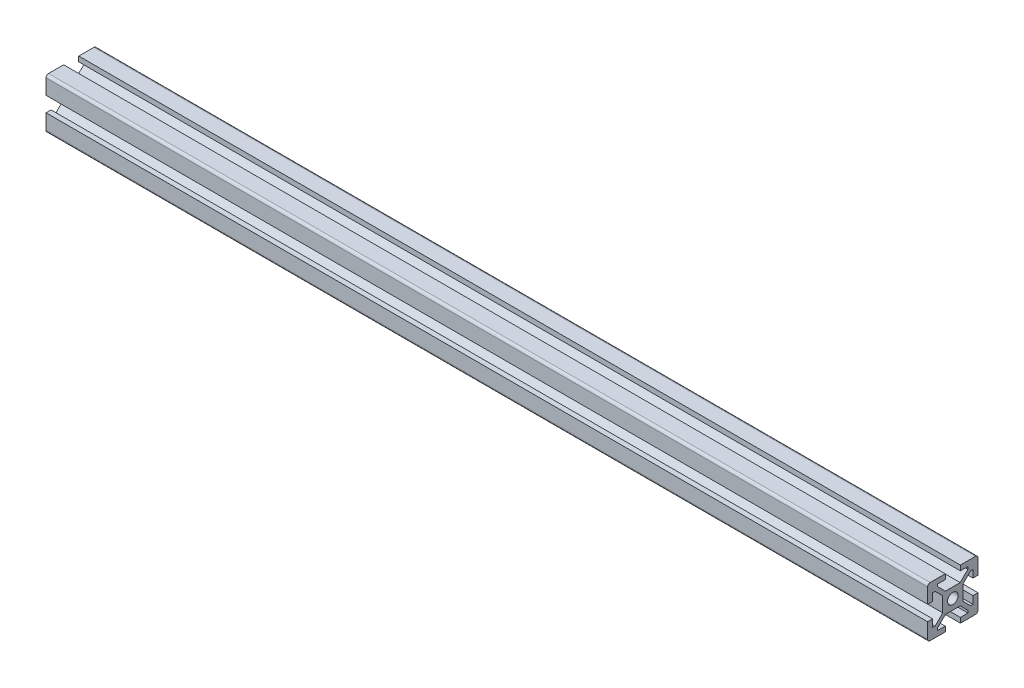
ISO-10303-21;
HEADER;
FILE_DESCRIPTION(('STEP AP214'),'2;1');
FILE_NAME('part.step','',(''),(''),'','','');
FILE_SCHEMA(('AUTOMOTIVE_DESIGN { 1 0 10303 214 1 1 1 1 }'));
ENDSEC;
DATA;
#1=APPLICATION_CONTEXT('core data for automotive mechanical design processes');
#2=APPLICATION_PROTOCOL_DEFINITION('international standard','automotive_design',2000,#1);
#3=PRODUCT_CONTEXT('',#1,'mechanical');
#4=PRODUCT('Part','Part','',(#3));
#5=PRODUCT_RELATED_PRODUCT_CATEGORY('part','',(#4));
#6=PRODUCT_DEFINITION_FORMATION('','',#4);
#7=PRODUCT_DEFINITION_CONTEXT('part definition',#1,'design');
#8=PRODUCT_DEFINITION('design','',#6,#7);
#9=PRODUCT_DEFINITION_SHAPE('','',#8);
#10=(LENGTH_UNIT() NAMED_UNIT(*) SI_UNIT(.MILLI.,.METRE.));
#11=(NAMED_UNIT(*) PLANE_ANGLE_UNIT() SI_UNIT($,.RADIAN.));
#12=(NAMED_UNIT(*) SI_UNIT($,.STERADIAN.) SOLID_ANGLE_UNIT());
#13=UNCERTAINTY_MEASURE_WITH_UNIT(LENGTH_MEASURE(1.E-05),#10,'distance_accuracy_value','');
#14=(GEOMETRIC_REPRESENTATION_CONTEXT(3) GLOBAL_UNCERTAINTY_ASSIGNED_CONTEXT((#13)) GLOBAL_UNIT_ASSIGNED_CONTEXT((#10,
#11,#12)) REPRESENTATION_CONTEXT('',''));
#15=CARTESIAN_POINT('',(0.,0.,0.));
#16=DIRECTION('',(0.,0.,1.));
#17=DIRECTION('',(1.,0.,0.));
#18=AXIS2_PLACEMENT_3D('',#15,#16,#17);
#19=CARTESIAN_POINT('',(350.,9.,9.));
#20=DIRECTION('',(1.,0.,0.));
#21=DIRECTION('',(0.,0.,-1.));
#22=AXIS2_PLACEMENT_3D('',#19,#20,#21);
#23=PLANE('',#22);
#24=CARTESIAN_POINT('',(350.,9.,9.));
#25=DIRECTION('',(1.,0.,0.));
#26=DIRECTION('',(0.,0.,-1.));
#27=AXIS2_PLACEMENT_3D('',#24,#25,#26);
#28=CIRCLE('',#27,1.);
#29=CARTESIAN_POINT('',(350.,10.,9.));
#30=VERTEX_POINT('',#29);
#31=CARTESIAN_POINT('',(350.,9.,10.));
#32=VERTEX_POINT('',#31);
#33=EDGE_CURVE('E471',#30,#32,#28,.T.);
#34=ORIENTED_EDGE('',*,*,#33,.T.);
#35=DIRECTION('',(0.,-1.,0.));
#36=VECTOR('',#35,1.);
#37=CARTESIAN_POINT('',(350.,9.,10.));
#38=LINE('',#37,#36);
#39=CARTESIAN_POINT('',(350.,3.,10.));
#40=VERTEX_POINT('',#39);
#41=EDGE_CURVE('E222',#32,#40,#38,.T.);
#42=ORIENTED_EDGE('',*,*,#41,.T.);
#43=DIRECTION('',(0.,0.,-1.));
#44=VECTOR('',#43,1.);
#45=CARTESIAN_POINT('',(350.,3.,10.));
#46=LINE('',#45,#44);
#47=CARTESIAN_POINT('',(350.,3.,8.));
#48=VERTEX_POINT('',#47);
#49=EDGE_CURVE('E609',#40,#48,#46,.T.);
#50=ORIENTED_EDGE('',*,*,#49,.T.);
#51=DIRECTION('',(0.,1.,0.));
#52=VECTOR('',#51,1.);
#53=CARTESIAN_POINT('',(350.,3.,8.));
#54=LINE('',#53,#52);
#55=CARTESIAN_POINT('',(350.,6.,8.));
#56=VERTEX_POINT('',#55);
#57=EDGE_CURVE('E630',#48,#56,#54,.T.);
#58=ORIENTED_EDGE('',*,*,#57,.T.);
#59=DIRECTION('',(0.,0.,-1.));
#60=VECTOR('',#59,1.);
#61=CARTESIAN_POINT('',(350.,6.,8.));
#62=LINE('',#61,#60);
#63=CARTESIAN_POINT('',(350.,6.,7.06066017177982));
#64=VERTEX_POINT('',#63);
#65=EDGE_CURVE('E624',#56,#64,#62,.T.);
#66=ORIENTED_EDGE('',*,*,#65,.T.);
#67=DIRECTION('',(0.,-0.707106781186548,-0.707106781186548));
#68=VECTOR('',#67,1.);
#69=CARTESIAN_POINT('',(350.,6.,7.06066017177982));
#70=LINE('',#69,#68);
#71=CARTESIAN_POINT('',(350.,2.93933982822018,4.));
#72=VERTEX_POINT('',#71);
#73=EDGE_CURVE('E627',#64,#72,#70,.T.);
#74=ORIENTED_EDGE('',*,*,#73,.T.);
#75=DIRECTION('',(0.,-1.,0.));
#76=VECTOR('',#75,1.);
#77=CARTESIAN_POINT('',(350.,2.93933982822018,4.));
#78=LINE('',#77,#76);
#79=CARTESIAN_POINT('',(350.,-2.93933982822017,4.));
#80=VERTEX_POINT('',#79);
#81=EDGE_CURVE('E626',#72,#80,#78,.T.);
#82=ORIENTED_EDGE('',*,*,#81,.T.);
#83=DIRECTION('',(0.,-0.707106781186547,0.707106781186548));
#84=VECTOR('',#83,1.);
#85=CARTESIAN_POINT('',(350.,-2.93933982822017,4.));
#86=LINE('',#85,#84);
#87=CARTESIAN_POINT('',(350.,-6.,7.06066017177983));
#88=VERTEX_POINT('',#87);
#89=EDGE_CURVE('E633',#80,#88,#86,.T.);
#90=ORIENTED_EDGE('',*,*,#89,.T.);
#91=DIRECTION('',(0.,0.,1.));
#92=VECTOR('',#91,1.);
#93=CARTESIAN_POINT('',(350.,-6.,7.06066017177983));
#94=LINE('',#93,#92);
#95=CARTESIAN_POINT('',(350.,-6.,7.99999999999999));
#96=VERTEX_POINT('',#95);
#97=EDGE_CURVE('E637',#88,#96,#94,.T.);
#98=ORIENTED_EDGE('',*,*,#97,.T.);
#99=DIRECTION('',(0.,1.,0.));
#100=VECTOR('',#99,1.);
#101=CARTESIAN_POINT('',(350.,-6.,7.99999999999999));
#102=LINE('',#101,#100);
#103=CARTESIAN_POINT('',(350.,-3.,7.99999999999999));
#104=VERTEX_POINT('',#103);
#105=EDGE_CURVE('E640',#96,#104,#102,.T.);
#106=ORIENTED_EDGE('',*,*,#105,.T.);
#107=DIRECTION('',(0.,0.,1.));
#108=VECTOR('',#107,1.);
#109=CARTESIAN_POINT('',(350.,-3.,7.99999999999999));
#110=LINE('',#109,#108);
#111=CARTESIAN_POINT('',(350.,-3.,10.));
#112=VERTEX_POINT('',#111);
#113=EDGE_CURVE('E643',#104,#112,#110,.T.);
#114=ORIENTED_EDGE('',*,*,#113,.T.);
#115=DIRECTION('',(0.,-1.,0.));
#116=VECTOR('',#115,1.);
#117=CARTESIAN_POINT('',(350.,-3.,10.));
#118=LINE('',#117,#116);
#119=CARTESIAN_POINT('',(350.,-9.,10.));
#120=VERTEX_POINT('',#119);
#121=EDGE_CURVE('E641',#112,#120,#118,.T.);
#122=ORIENTED_EDGE('',*,*,#121,.T.);
#123=CARTESIAN_POINT('',(350.,-9.,9.));
#124=DIRECTION('',(1.,0.,0.));
#125=DIRECTION('',(0.,0.,-1.));
#126=AXIS2_PLACEMENT_3D('',#123,#124,#125);
#127=CIRCLE('',#126,1.);
#128=CARTESIAN_POINT('',(350.,-10.,9.));
#129=VERTEX_POINT('',#128);
#130=EDGE_CURVE('E642',#120,#129,#127,.T.);
#131=ORIENTED_EDGE('',*,*,#130,.T.);
#132=DIRECTION('',(0.,0.,-1.));
#133=VECTOR('',#132,1.);
#134=CARTESIAN_POINT('',(350.,-10.,9.));
#135=LINE('',#134,#133);
#136=CARTESIAN_POINT('',(350.,-10.,3.));
#137=VERTEX_POINT('',#136);
#138=EDGE_CURVE('E650',#129,#137,#135,.T.);
#139=ORIENTED_EDGE('',*,*,#138,.T.);
#140=DIRECTION('',(0.,1.,0.));
#141=VECTOR('',#140,1.);
#142=CARTESIAN_POINT('',(350.,-10.,3.));
#143=LINE('',#142,#141);
#144=CARTESIAN_POINT('',(350.,-8.,3.));
#145=VERTEX_POINT('',#144);
#146=EDGE_CURVE('E647',#137,#145,#143,.T.);
#147=ORIENTED_EDGE('',*,*,#146,.T.);
#148=DIRECTION('',(0.,0.,1.));
#149=VECTOR('',#148,1.);
#150=CARTESIAN_POINT('',(350.,-8.,3.));
#151=LINE('',#150,#149);
#152=CARTESIAN_POINT('',(350.,-8.,6.));
#153=VERTEX_POINT('',#152);
#154=EDGE_CURVE('E651',#145,#153,#151,.T.);
#155=ORIENTED_EDGE('',*,*,#154,.T.);
#156=DIRECTION('',(0.,1.,0.));
#157=VECTOR('',#156,1.);
#158=CARTESIAN_POINT('',(350.,-8.,6.));
#159=LINE('',#158,#157);
#160=CARTESIAN_POINT('',(350.,-7.06066017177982,6.));
#161=VERTEX_POINT('',#160);
#162=EDGE_CURVE('E653',#153,#161,#159,.T.);
#163=ORIENTED_EDGE('',*,*,#162,.T.);
#164=DIRECTION('',(0.,0.707106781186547,-0.707106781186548));
#165=VECTOR('',#164,1.);
#166=CARTESIAN_POINT('',(350.,-7.06066017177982,6.));
#167=LINE('',#166,#165);
#168=CARTESIAN_POINT('',(350.,-4.,2.93933982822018));
#169=VERTEX_POINT('',#168);
#170=EDGE_CURVE('E654',#161,#169,#167,.T.);
#171=ORIENTED_EDGE('',*,*,#170,.T.);
#172=DIRECTION('',(0.,0.,-1.));
#173=VECTOR('',#172,1.);
#174=CARTESIAN_POINT('',(350.,-4.,2.93933982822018));
#175=LINE('',#174,#173);
#176=CARTESIAN_POINT('',(350.,-4.,-2.93933982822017));
#177=VERTEX_POINT('',#176);
#178=EDGE_CURVE('E660',#169,#177,#175,.T.);
#179=ORIENTED_EDGE('',*,*,#178,.T.);
#180=DIRECTION('',(0.,-0.707106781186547,-0.707106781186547));
#181=VECTOR('',#180,1.);
#182=CARTESIAN_POINT('',(350.,-4.,-2.93933982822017));
#183=LINE('',#182,#181);
#184=CARTESIAN_POINT('',(350.,-7.06066017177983,-6.));
#185=VERTEX_POINT('',#184);
#186=EDGE_CURVE('E658',#177,#185,#183,.T.);
#187=ORIENTED_EDGE('',*,*,#186,.T.);
#188=DIRECTION('',(0.,-1.,0.));
#189=VECTOR('',#188,1.);
#190=CARTESIAN_POINT('',(350.,-7.06066017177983,-6.));
#191=LINE('',#190,#189);
#192=CARTESIAN_POINT('',(350.,-7.99999999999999,-6.));
#193=VERTEX_POINT('',#192);
#194=EDGE_CURVE('E662',#185,#193,#191,.T.);
#195=ORIENTED_EDGE('',*,*,#194,.T.);
#196=DIRECTION('',(0.,0.,1.));
#197=VECTOR('',#196,1.);
#198=CARTESIAN_POINT('',(350.,-7.99999999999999,-6.));
#199=LINE('',#198,#197);
#200=CARTESIAN_POINT('',(350.,-7.99999999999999,-3.));
#201=VERTEX_POINT('',#200);
#202=EDGE_CURVE('E664',#193,#201,#199,.T.);
#203=ORIENTED_EDGE('',*,*,#202,.T.);
#204=DIRECTION('',(0.,-1.,0.));
#205=VECTOR('',#204,1.);
#206=CARTESIAN_POINT('',(350.,-7.99999999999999,-3.));
#207=LINE('',#206,#205);
#208=CARTESIAN_POINT('',(350.,-10.,-3.));
#209=VERTEX_POINT('',#208);
#210=EDGE_CURVE('E663',#201,#209,#207,.T.);
#211=ORIENTED_EDGE('',*,*,#210,.T.);
#212=DIRECTION('',(0.,0.,-1.));
#213=VECTOR('',#212,1.);
#214=CARTESIAN_POINT('',(350.,-10.,-3.));
#215=LINE('',#214,#213);
#216=CARTESIAN_POINT('',(350.,-10.,-9.00000000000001));
#217=VERTEX_POINT('',#216);
#218=EDGE_CURVE('E670',#209,#217,#215,.T.);
#219=ORIENTED_EDGE('',*,*,#218,.T.);
#220=CARTESIAN_POINT('',(350.,-9.,-9.00000000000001));
#221=DIRECTION('',(1.,0.,0.));
#222=DIRECTION('',(0.,0.,-1.));
#223=AXIS2_PLACEMENT_3D('',#220,#221,#222);
#224=CIRCLE('',#223,0.999999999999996);
#225=CARTESIAN_POINT('',(350.,-9.,-10.));
#226=VERTEX_POINT('',#225);
#227=EDGE_CURVE('E666',#217,#226,#224,.T.);
#228=ORIENTED_EDGE('',*,*,#227,.T.);
#229=DIRECTION('',(0.,1.,0.));
#230=VECTOR('',#229,1.);
#231=CARTESIAN_POINT('',(350.,-9.,-10.));
#232=LINE('',#231,#230);
#233=CARTESIAN_POINT('',(350.,-3.,-10.));
#234=VERTEX_POINT('',#233);
#235=EDGE_CURVE('E672',#226,#234,#232,.T.);
#236=ORIENTED_EDGE('',*,*,#235,.T.);
#237=DIRECTION('',(0.,0.,1.));
#238=VECTOR('',#237,1.);
#239=CARTESIAN_POINT('',(350.,-3.,-10.));
#240=LINE('',#239,#238);
#241=CARTESIAN_POINT('',(350.,-3.,-8.00000000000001));
#242=VERTEX_POINT('',#241);
#243=EDGE_CURVE('E674',#234,#242,#240,.T.);
#244=ORIENTED_EDGE('',*,*,#243,.T.);
#245=DIRECTION('',(0.,-1.,0.));
#246=VECTOR('',#245,1.);
#247=CARTESIAN_POINT('',(350.,-3.,-8.00000000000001));
#248=LINE('',#247,#246);
#249=CARTESIAN_POINT('',(350.,-6.,-8.00000000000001));
#250=VERTEX_POINT('',#249);
#251=EDGE_CURVE('E673',#242,#250,#248,.T.);
#252=ORIENTED_EDGE('',*,*,#251,.T.);
#253=DIRECTION('',(0.,0.,1.));
#254=VECTOR('',#253,1.);
#255=CARTESIAN_POINT('',(350.,-6.,-8.00000000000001));
#256=LINE('',#255,#254);
#257=CARTESIAN_POINT('',(350.,-6.,-7.06066017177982));
#258=VERTEX_POINT('',#257);
#259=EDGE_CURVE('E680',#250,#258,#256,.T.);
#260=ORIENTED_EDGE('',*,*,#259,.T.);
#261=DIRECTION('',(0.,0.707106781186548,0.707106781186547));
#262=VECTOR('',#261,1.);
#263=CARTESIAN_POINT('',(350.,-6.,-7.06066017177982));
#264=LINE('',#263,#262);
#265=CARTESIAN_POINT('',(350.,-2.93933982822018,-4.));
#266=VERTEX_POINT('',#265);
#267=EDGE_CURVE('E679',#258,#266,#264,.T.);
#268=ORIENTED_EDGE('',*,*,#267,.T.);
#269=DIRECTION('',(0.,1.,0.));
#270=VECTOR('',#269,1.);
#271=CARTESIAN_POINT('',(350.,-2.93933982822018,-4.));
#272=LINE('',#271,#270);
#273=CARTESIAN_POINT('',(350.,2.93933982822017,-4.));
#274=VERTEX_POINT('',#273);
#275=EDGE_CURVE('E682',#266,#274,#272,.T.);
#276=ORIENTED_EDGE('',*,*,#275,.T.);
#277=DIRECTION('',(0.,0.707106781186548,-0.707106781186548));
#278=VECTOR('',#277,1.);
#279=CARTESIAN_POINT('',(350.,2.93933982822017,-4.));
#280=LINE('',#279,#278);
#281=CARTESIAN_POINT('',(350.,6.,-7.06066017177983));
#282=VERTEX_POINT('',#281);
#283=EDGE_CURVE('E684',#274,#282,#280,.T.);
#284=ORIENTED_EDGE('',*,*,#283,.T.);
#285=DIRECTION('',(0.,0.,-1.));
#286=VECTOR('',#285,1.);
#287=CARTESIAN_POINT('',(350.,6.,-7.06066017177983));
#288=LINE('',#287,#286);
#289=CARTESIAN_POINT('',(350.,6.,-7.99999999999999));
#290=VERTEX_POINT('',#289);
#291=EDGE_CURVE('E683',#282,#290,#288,.T.);
#292=ORIENTED_EDGE('',*,*,#291,.T.);
#293=DIRECTION('',(0.,-1.,0.));
#294=VECTOR('',#293,1.);
#295=CARTESIAN_POINT('',(350.,6.,-7.99999999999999));
#296=LINE('',#295,#294);
#297=CARTESIAN_POINT('',(350.,3.,-7.99999999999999));
#298=VERTEX_POINT('',#297);
#299=EDGE_CURVE('E690',#290,#298,#296,.T.);
#300=ORIENTED_EDGE('',*,*,#299,.T.);
#301=DIRECTION('',(0.,0.,-1.));
#302=VECTOR('',#301,1.);
#303=CARTESIAN_POINT('',(350.,3.,-7.99999999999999));
#304=LINE('',#303,#302);
#305=CARTESIAN_POINT('',(350.,3.,-10.));
#306=VERTEX_POINT('',#305);
#307=EDGE_CURVE('E686',#298,#306,#304,.T.);
#308=ORIENTED_EDGE('',*,*,#307,.T.);
#309=DIRECTION('',(0.,1.,0.));
#310=VECTOR('',#309,1.);
#311=CARTESIAN_POINT('',(350.,3.,-10.));
#312=LINE('',#311,#310);
#313=CARTESIAN_POINT('',(350.,9.,-10.));
#314=VERTEX_POINT('',#313);
#315=EDGE_CURVE('E693',#306,#314,#312,.T.);
#316=ORIENTED_EDGE('',*,*,#315,.T.);
#317=CARTESIAN_POINT('',(350.,9.,-9.00000000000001));
#318=DIRECTION('',(1.,0.,0.));
#319=DIRECTION('',(0.,0.,-1.));
#320=AXIS2_PLACEMENT_3D('',#317,#318,#319);
#321=CIRCLE('',#320,1.);
#322=CARTESIAN_POINT('',(350.,10.,-9.00000000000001));
#323=VERTEX_POINT('',#322);
#324=EDGE_CURVE('E691',#314,#323,#321,.T.);
#325=ORIENTED_EDGE('',*,*,#324,.T.);
#326=DIRECTION('',(0.,0.,1.));
#327=VECTOR('',#326,1.);
#328=CARTESIAN_POINT('',(350.,10.,-9.00000000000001));
#329=LINE('',#328,#327);
#330=CARTESIAN_POINT('',(350.,10.,-3.));
#331=VERTEX_POINT('',#330);
#332=EDGE_CURVE('E694',#323,#331,#329,.T.);
#333=ORIENTED_EDGE('',*,*,#332,.T.);
#334=DIRECTION('',(0.,-1.,0.));
#335=VECTOR('',#334,1.);
#336=CARTESIAN_POINT('',(350.,10.,-3.));
#337=LINE('',#336,#335);
#338=CARTESIAN_POINT('',(350.,8.,-3.));
#339=VERTEX_POINT('',#338);
#340=EDGE_CURVE('E700',#331,#339,#337,.T.);
#341=ORIENTED_EDGE('',*,*,#340,.T.);
#342=DIRECTION('',(0.,0.,-1.));
#343=VECTOR('',#342,1.);
#344=CARTESIAN_POINT('',(350.,8.,-3.));
#345=LINE('',#344,#343);
#346=CARTESIAN_POINT('',(350.,8.,-6.));
#347=VERTEX_POINT('',#346);
#348=EDGE_CURVE('E699',#339,#347,#345,.T.);
#349=ORIENTED_EDGE('',*,*,#348,.T.);
#350=DIRECTION('',(0.,-1.,0.));
#351=VECTOR('',#350,1.);
#352=CARTESIAN_POINT('',(350.,8.,-6.));
#353=LINE('',#352,#351);
#354=CARTESIAN_POINT('',(350.,7.06066017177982,-6.));
#355=VERTEX_POINT('',#354);
#356=EDGE_CURVE('E701',#347,#355,#353,.T.);
#357=ORIENTED_EDGE('',*,*,#356,.T.);
#358=DIRECTION('',(0.,-0.707106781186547,0.707106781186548));
#359=VECTOR('',#358,1.);
#360=CARTESIAN_POINT('',(350.,7.06066017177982,-6.));
#361=LINE('',#360,#359);
#362=CARTESIAN_POINT('',(350.,4.,-2.93933982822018));
#363=VERTEX_POINT('',#362);
#364=EDGE_CURVE('E703',#355,#363,#361,.T.);
#365=ORIENTED_EDGE('',*,*,#364,.T.);
#366=DIRECTION('',(0.,0.,1.));
#367=VECTOR('',#366,1.);
#368=CARTESIAN_POINT('',(350.,4.,-2.93933982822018));
#369=LINE('',#368,#367);
#370=CARTESIAN_POINT('',(350.,4.,2.93933982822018));
#371=VERTEX_POINT('',#370);
#372=EDGE_CURVE('E704',#363,#371,#369,.T.);
#373=ORIENTED_EDGE('',*,*,#372,.T.);
#374=DIRECTION('',(0.,0.707106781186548,0.707106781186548));
#375=VECTOR('',#374,1.);
#376=CARTESIAN_POINT('',(350.,4.,2.93933982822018));
#377=LINE('',#376,#375);
#378=CARTESIAN_POINT('',(350.,7.06066017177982,6.));
#379=VERTEX_POINT('',#378);
#380=EDGE_CURVE('E710',#371,#379,#377,.T.);
#381=ORIENTED_EDGE('',*,*,#380,.T.);
#382=DIRECTION('',(0.,1.,0.));
#383=VECTOR('',#382,1.);
#384=CARTESIAN_POINT('',(350.,7.06066017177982,6.));
#385=LINE('',#384,#383);
#386=CARTESIAN_POINT('',(350.,7.99999999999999,6.));
#387=VERTEX_POINT('',#386);
#388=EDGE_CURVE('E358',#379,#387,#385,.T.);
#389=ORIENTED_EDGE('',*,*,#388,.T.);
#390=DIRECTION('',(0.,0.,-1.));
#391=VECTOR('',#390,1.);
#392=CARTESIAN_POINT('',(350.,7.99999999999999,6.));
#393=LINE('',#392,#391);
#394=CARTESIAN_POINT('',(350.,7.99999999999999,3.));
#395=VERTEX_POINT('',#394);
#396=EDGE_CURVE('E351',#387,#395,#393,.T.);
#397=ORIENTED_EDGE('',*,*,#396,.T.);
#398=DIRECTION('',(0.,1.,0.));
#399=VECTOR('',#398,1.);
#400=CARTESIAN_POINT('',(350.,7.99999999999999,3.));
#401=LINE('',#400,#399);
#402=CARTESIAN_POINT('',(350.,10.,3.));
#403=VERTEX_POINT('',#402);
#404=EDGE_CURVE('E359',#395,#403,#401,.T.);
#405=ORIENTED_EDGE('',*,*,#404,.T.);
#406=DIRECTION('',(0.,0.,1.));
#407=VECTOR('',#406,1.);
#408=CARTESIAN_POINT('',(350.,10.,3.));
#409=LINE('',#408,#407);
#410=EDGE_CURVE('E59',#403,#30,#409,.T.);
#411=ORIENTED_EDGE('',*,*,#410,.T.);
#412=EDGE_LOOP('',(#34,#42,#50,#58,#66,#74,#82,#90,#98,#106,#114,#122,#131,#139,#147,#155,#163,
#171,#179,#187,#195,#203,#211,#219,#228,#236,#244,#252,#260,#268,#276,#284,#292,#300,#308,#316,
#325,#333,#341,#349,#357,#365,#373,#381,#389,#397,#405,#411));
#413=FACE_BOUND('',#412,.T.);
#414=CARTESIAN_POINT('',(350.,0.,0.));
#415=DIRECTION('',(1.,0.,0.));
#416=DIRECTION('',(0.,0.,-1.));
#417=AXIS2_PLACEMENT_3D('',#414,#415,#416);
#418=CIRCLE('',#417,2.1);
#419=CARTESIAN_POINT('',(350.,0.,-2.1));
#420=VERTEX_POINT('',#419);
#421=EDGE_CURVE('E385',#420,#420,#418,.T.);
#422=ORIENTED_EDGE('',*,*,#421,.F.);
#423=EDGE_LOOP('',(#422));
#424=FACE_BOUND('',#423,.T.);
#425=ADVANCED_FACE('F41',(#413,#424),#23,.T.);
#426=CARTESIAN_POINT('',(0.,9.,9.));
#427=DIRECTION('',(1.,0.,0.));
#428=DIRECTION('',(0.,0.,-1.));
#429=AXIS2_PLACEMENT_3D('',#426,#427,#428);
#430=PLANE('',#429);
#431=CARTESIAN_POINT('',(0.,9.,9.));
#432=DIRECTION('',(1.,0.,0.));
#433=DIRECTION('',(0.,0.,-1.));
#434=AXIS2_PLACEMENT_3D('',#431,#432,#433);
#435=CIRCLE('',#434,1.);
#436=CARTESIAN_POINT('',(0.,10.,9.));
#437=VERTEX_POINT('',#436);
#438=CARTESIAN_POINT('',(0.,9.,10.));
#439=VERTEX_POINT('',#438);
#440=EDGE_CURVE('E378',#437,#439,#435,.T.);
#441=ORIENTED_EDGE('',*,*,#440,.F.);
#442=DIRECTION('',(0.,0.,1.));
#443=VECTOR('',#442,1.);
#444=CARTESIAN_POINT('',(0.,10.,3.));
#445=LINE('',#444,#443);
#446=CARTESIAN_POINT('',(0.,10.,3.));
#447=VERTEX_POINT('',#446);
#448=EDGE_CURVE('E213',#447,#437,#445,.T.);
#449=ORIENTED_EDGE('',*,*,#448,.F.);
#450=DIRECTION('',(0.,1.,0.));
#451=VECTOR('',#450,1.);
#452=CARTESIAN_POINT('',(0.,7.99999999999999,3.));
#453=LINE('',#452,#451);
#454=CARTESIAN_POINT('',(0.,7.99999999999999,3.));
#455=VERTEX_POINT('',#454);
#456=EDGE_CURVE('E210',#455,#447,#453,.T.);
#457=ORIENTED_EDGE('',*,*,#456,.F.);
#458=DIRECTION('',(0.,0.,-1.));
#459=VECTOR('',#458,1.);
#460=CARTESIAN_POINT('',(0.,7.99999999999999,6.));
#461=LINE('',#460,#459);
#462=CARTESIAN_POINT('',(0.,7.99999999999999,6.));
#463=VERTEX_POINT('',#462);
#464=EDGE_CURVE('E366',#463,#455,#461,.T.);
#465=ORIENTED_EDGE('',*,*,#464,.F.);
#466=DIRECTION('',(0.,1.,0.));
#467=VECTOR('',#466,1.);
#468=CARTESIAN_POINT('',(0.,7.06066017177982,6.));
#469=LINE('',#468,#467);
#470=CARTESIAN_POINT('',(0.,7.06066017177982,6.));
#471=VERTEX_POINT('',#470);
#472=EDGE_CURVE('E469',#471,#463,#469,.T.);
#473=ORIENTED_EDGE('',*,*,#472,.F.);
#474=DIRECTION('',(0.,0.707106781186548,0.707106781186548));
#475=VECTOR('',#474,1.);
#476=CARTESIAN_POINT('',(0.,4.,2.93933982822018));
#477=LINE('',#476,#475);
#478=CARTESIAN_POINT('',(0.,4.,2.93933982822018));
#479=VERTEX_POINT('',#478);
#480=EDGE_CURVE('E467',#479,#471,#477,.T.);
#481=ORIENTED_EDGE('',*,*,#480,.F.);
#482=DIRECTION('',(0.,0.,1.));
#483=VECTOR('',#482,1.);
#484=CARTESIAN_POINT('',(0.,4.,-2.93933982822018));
#485=LINE('',#484,#483);
#486=CARTESIAN_POINT('',(0.,4.,-2.93933982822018));
#487=VERTEX_POINT('',#486);
#488=EDGE_CURVE('E461',#487,#479,#485,.T.);
#489=ORIENTED_EDGE('',*,*,#488,.F.);
#490=DIRECTION('',(0.,-0.707106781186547,0.707106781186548));
#491=VECTOR('',#490,1.);
#492=CARTESIAN_POINT('',(0.,7.06066017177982,-6.));
#493=LINE('',#492,#491);
#494=CARTESIAN_POINT('',(0.,7.06066017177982,-6.));
#495=VERTEX_POINT('',#494);
#496=EDGE_CURVE('E465',#495,#487,#493,.T.);
#497=ORIENTED_EDGE('',*,*,#496,.F.);
#498=DIRECTION('',(0.,-1.,0.));
#499=VECTOR('',#498,1.);
#500=CARTESIAN_POINT('',(0.,8.,-6.));
#501=LINE('',#500,#499);
#502=CARTESIAN_POINT('',(0.,8.,-6.));
#503=VERTEX_POINT('',#502);
#504=EDGE_CURVE('E458',#503,#495,#501,.T.);
#505=ORIENTED_EDGE('',*,*,#504,.F.);
#506=DIRECTION('',(0.,0.,-1.));
#507=VECTOR('',#506,1.);
#508=CARTESIAN_POINT('',(0.,8.,-3.));
#509=LINE('',#508,#507);
#510=CARTESIAN_POINT('',(0.,8.,-3.));
#511=VERTEX_POINT('',#510);
#512=EDGE_CURVE('E456',#511,#503,#509,.T.);
#513=ORIENTED_EDGE('',*,*,#512,.F.);
#514=DIRECTION('',(0.,-1.,0.));
#515=VECTOR('',#514,1.);
#516=CARTESIAN_POINT('',(0.,10.,-3.));
#517=LINE('',#516,#515);
#518=CARTESIAN_POINT('',(0.,10.,-3.));
#519=VERTEX_POINT('',#518);
#520=EDGE_CURVE('E457',#519,#511,#517,.T.);
#521=ORIENTED_EDGE('',*,*,#520,.F.);
#522=DIRECTION('',(0.,0.,1.));
#523=VECTOR('',#522,1.);
#524=CARTESIAN_POINT('',(0.,10.,-9.00000000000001));
#525=LINE('',#524,#523);
#526=CARTESIAN_POINT('',(0.,10.,-9.00000000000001));
#527=VERTEX_POINT('',#526);
#528=EDGE_CURVE('E451',#527,#519,#525,.T.);
#529=ORIENTED_EDGE('',*,*,#528,.F.);
#530=CARTESIAN_POINT('',(0.,9.,-9.00000000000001));
#531=DIRECTION('',(1.,0.,0.));
#532=DIRECTION('',(0.,0.,-1.));
#533=AXIS2_PLACEMENT_3D('',#530,#531,#532);
#534=CIRCLE('',#533,1.);
#535=CARTESIAN_POINT('',(0.,9.,-10.));
#536=VERTEX_POINT('',#535);
#537=EDGE_CURVE('E455',#536,#527,#534,.T.);
#538=ORIENTED_EDGE('',*,*,#537,.F.);
#539=DIRECTION('',(0.,1.,0.));
#540=VECTOR('',#539,1.);
#541=CARTESIAN_POINT('',(0.,3.,-10.));
#542=LINE('',#541,#540);
#543=CARTESIAN_POINT('',(0.,3.,-10.));
#544=VERTEX_POINT('',#543);
#545=EDGE_CURVE('E448',#544,#536,#542,.T.);
#546=ORIENTED_EDGE('',*,*,#545,.F.);
#547=DIRECTION('',(0.,0.,-1.));
#548=VECTOR('',#547,1.);
#549=CARTESIAN_POINT('',(0.,3.,-7.99999999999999));
#550=LINE('',#549,#548);
#551=CARTESIAN_POINT('',(0.,3.,-7.99999999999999));
#552=VERTEX_POINT('',#551);
#553=EDGE_CURVE('E449',#552,#544,#550,.T.);
#554=ORIENTED_EDGE('',*,*,#553,.F.);
#555=DIRECTION('',(0.,-1.,0.));
#556=VECTOR('',#555,1.);
#557=CARTESIAN_POINT('',(0.,6.,-7.99999999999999));
#558=LINE('',#557,#556);
#559=CARTESIAN_POINT('',(0.,6.,-7.99999999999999));
#560=VERTEX_POINT('',#559);
#561=EDGE_CURVE('E447',#560,#552,#558,.T.);
#562=ORIENTED_EDGE('',*,*,#561,.F.);
#563=DIRECTION('',(0.,0.,-1.));
#564=VECTOR('',#563,1.);
#565=CARTESIAN_POINT('',(0.,6.,-7.06066017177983));
#566=LINE('',#565,#564);
#567=CARTESIAN_POINT('',(0.,6.,-7.06066017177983));
#568=VERTEX_POINT('',#567);
#569=EDGE_CURVE('E441',#568,#560,#566,.T.);
#570=ORIENTED_EDGE('',*,*,#569,.F.);
#571=DIRECTION('',(0.,0.707106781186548,-0.707106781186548));
#572=VECTOR('',#571,1.);
#573=CARTESIAN_POINT('',(0.,2.93933982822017,-4.));
#574=LINE('',#573,#572);
#575=CARTESIAN_POINT('',(0.,2.93933982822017,-4.));
#576=VERTEX_POINT('',#575);
#577=EDGE_CURVE('E445',#576,#568,#574,.T.);
#578=ORIENTED_EDGE('',*,*,#577,.F.);
#579=DIRECTION('',(0.,1.,0.));
#580=VECTOR('',#579,1.);
#581=CARTESIAN_POINT('',(0.,-2.93933982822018,-4.));
#582=LINE('',#581,#580);
#583=CARTESIAN_POINT('',(0.,-2.93933982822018,-4.));
#584=VERTEX_POINT('',#583);
#585=EDGE_CURVE('E439',#584,#576,#582,.T.);
#586=ORIENTED_EDGE('',*,*,#585,.F.);
#587=DIRECTION('',(0.,0.707106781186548,0.707106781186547));
#588=VECTOR('',#587,1.);
#589=CARTESIAN_POINT('',(0.,-6.,-7.06066017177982));
#590=LINE('',#589,#588);
#591=CARTESIAN_POINT('',(0.,-6.,-7.06066017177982));
#592=VERTEX_POINT('',#591);
#593=EDGE_CURVE('E437',#592,#584,#590,.T.);
#594=ORIENTED_EDGE('',*,*,#593,.F.);
#595=DIRECTION('',(0.,0.,1.));
#596=VECTOR('',#595,1.);
#597=CARTESIAN_POINT('',(0.,-6.,-8.00000000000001));
#598=LINE('',#597,#596);
#599=CARTESIAN_POINT('',(0.,-6.,-8.00000000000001));
#600=VERTEX_POINT('',#599);
#601=EDGE_CURVE('E436',#600,#592,#598,.T.);
#602=ORIENTED_EDGE('',*,*,#601,.F.);
#603=DIRECTION('',(0.,-1.,0.));
#604=VECTOR('',#603,1.);
#605=CARTESIAN_POINT('',(0.,-3.,-8.00000000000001));
#606=LINE('',#605,#604);
#607=CARTESIAN_POINT('',(0.,-3.,-8.00000000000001));
#608=VERTEX_POINT('',#607);
#609=EDGE_CURVE('E432',#608,#600,#606,.T.);
#610=ORIENTED_EDGE('',*,*,#609,.F.);
#611=DIRECTION('',(0.,0.,1.));
#612=VECTOR('',#611,1.);
#613=CARTESIAN_POINT('',(0.,-3.,-10.));
#614=LINE('',#613,#612);
#615=CARTESIAN_POINT('',(0.,-3.,-10.));
#616=VERTEX_POINT('',#615);
#617=EDGE_CURVE('E435',#616,#608,#614,.T.);
#618=ORIENTED_EDGE('',*,*,#617,.F.);
#619=DIRECTION('',(0.,1.,0.));
#620=VECTOR('',#619,1.);
#621=CARTESIAN_POINT('',(0.,-9.,-10.));
#622=LINE('',#621,#620);
#623=CARTESIAN_POINT('',(0.,-9.,-10.));
#624=VERTEX_POINT('',#623);
#625=EDGE_CURVE('E429',#624,#616,#622,.T.);
#626=ORIENTED_EDGE('',*,*,#625,.F.);
#627=CARTESIAN_POINT('',(0.,-9.,-9.00000000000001));
#628=DIRECTION('',(1.,0.,0.));
#629=DIRECTION('',(0.,0.,-1.));
#630=AXIS2_PLACEMENT_3D('',#627,#628,#629);
#631=CIRCLE('',#630,0.999999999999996);
#632=CARTESIAN_POINT('',(0.,-10.,-9.00000000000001));
#633=VERTEX_POINT('',#632);
#634=EDGE_CURVE('E428',#633,#624,#631,.T.);
#635=ORIENTED_EDGE('',*,*,#634,.F.);
#636=DIRECTION('',(0.,0.,-1.));
#637=VECTOR('',#636,1.);
#638=CARTESIAN_POINT('',(0.,-10.,-3.));
#639=LINE('',#638,#637);
#640=CARTESIAN_POINT('',(0.,-10.,-3.));
#641=VERTEX_POINT('',#640);
#642=EDGE_CURVE('E426',#641,#633,#639,.T.);
#643=ORIENTED_EDGE('',*,*,#642,.F.);
#644=DIRECTION('',(0.,-1.,0.));
#645=VECTOR('',#644,1.);
#646=CARTESIAN_POINT('',(0.,-7.99999999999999,-3.));
#647=LINE('',#646,#645);
#648=CARTESIAN_POINT('',(0.,-7.99999999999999,-3.));
#649=VERTEX_POINT('',#648);
#650=EDGE_CURVE('E424',#649,#641,#647,.T.);
#651=ORIENTED_EDGE('',*,*,#650,.F.);
#652=DIRECTION('',(0.,0.,1.));
#653=VECTOR('',#652,1.);
#654=CARTESIAN_POINT('',(0.,-7.99999999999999,-6.));
#655=LINE('',#654,#653);
#656=CARTESIAN_POINT('',(0.,-7.99999999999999,-6.));
#657=VERTEX_POINT('',#656);
#658=EDGE_CURVE('E425',#657,#649,#655,.T.);
#659=ORIENTED_EDGE('',*,*,#658,.F.);
#660=DIRECTION('',(0.,-1.,0.));
#661=VECTOR('',#660,1.);
#662=CARTESIAN_POINT('',(0.,-7.06066017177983,-6.));
#663=LINE('',#662,#661);
#664=CARTESIAN_POINT('',(0.,-7.06066017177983,-6.));
#665=VERTEX_POINT('',#664);
#666=EDGE_CURVE('E419',#665,#657,#663,.T.);
#667=ORIENTED_EDGE('',*,*,#666,.F.);
#668=DIRECTION('',(0.,-0.707106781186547,-0.707106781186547));
#669=VECTOR('',#668,1.);
#670=CARTESIAN_POINT('',(0.,-4.,-2.93933982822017));
#671=LINE('',#670,#669);
#672=CARTESIAN_POINT('',(0.,-4.,-2.93933982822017));
#673=VERTEX_POINT('',#672);
#674=EDGE_CURVE('E416',#673,#665,#671,.T.);
#675=ORIENTED_EDGE('',*,*,#674,.F.);
#676=DIRECTION('',(0.,0.,-1.));
#677=VECTOR('',#676,1.);
#678=CARTESIAN_POINT('',(0.,-4.,2.93933982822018));
#679=LINE('',#678,#677);
#680=CARTESIAN_POINT('',(0.,-4.,2.93933982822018));
#681=VERTEX_POINT('',#680);
#682=EDGE_CURVE('E418',#681,#673,#679,.T.);
#683=ORIENTED_EDGE('',*,*,#682,.F.);
#684=DIRECTION('',(0.,0.707106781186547,-0.707106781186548));
#685=VECTOR('',#684,1.);
#686=CARTESIAN_POINT('',(0.,-7.06066017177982,6.));
#687=LINE('',#686,#685);
#688=CARTESIAN_POINT('',(0.,-7.06066017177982,6.));
#689=VERTEX_POINT('',#688);
#690=EDGE_CURVE('E411',#689,#681,#687,.T.);
#691=ORIENTED_EDGE('',*,*,#690,.F.);
#692=DIRECTION('',(0.,1.,0.));
#693=VECTOR('',#692,1.);
#694=CARTESIAN_POINT('',(0.,-8.,6.));
#695=LINE('',#694,#693);
#696=CARTESIAN_POINT('',(0.,-8.,6.));
#697=VERTEX_POINT('',#696);
#698=EDGE_CURVE('E415',#697,#689,#695,.T.);
#699=ORIENTED_EDGE('',*,*,#698,.F.);
#700=DIRECTION('',(0.,0.,1.));
#701=VECTOR('',#700,1.);
#702=CARTESIAN_POINT('',(0.,-8.,3.));
#703=LINE('',#702,#701);
#704=CARTESIAN_POINT('',(0.,-8.,3.));
#705=VERTEX_POINT('',#704);
#706=EDGE_CURVE('E408',#705,#697,#703,.T.);
#707=ORIENTED_EDGE('',*,*,#706,.F.);
#708=DIRECTION('',(0.,1.,0.));
#709=VECTOR('',#708,1.);
#710=CARTESIAN_POINT('',(0.,-10.,3.));
#711=LINE('',#710,#709);
#712=CARTESIAN_POINT('',(0.,-10.,3.));
#713=VERTEX_POINT('',#712);
#714=EDGE_CURVE('E409',#713,#705,#711,.T.);
#715=ORIENTED_EDGE('',*,*,#714,.F.);
#716=DIRECTION('',(0.,0.,-1.));
#717=VECTOR('',#716,1.);
#718=CARTESIAN_POINT('',(0.,-10.,9.));
#719=LINE('',#718,#717);
#720=CARTESIAN_POINT('',(0.,-10.,9.));
#721=VERTEX_POINT('',#720);
#722=EDGE_CURVE('E407',#721,#713,#719,.T.);
#723=ORIENTED_EDGE('',*,*,#722,.F.);
#724=CARTESIAN_POINT('',(0.,-9.,9.));
#725=DIRECTION('',(1.,0.,0.));
#726=DIRECTION('',(0.,0.,-1.));
#727=AXIS2_PLACEMENT_3D('',#724,#725,#726);
#728=CIRCLE('',#727,1.);
#729=CARTESIAN_POINT('',(0.,-9.,10.));
#730=VERTEX_POINT('',#729);
#731=EDGE_CURVE('E404',#730,#721,#728,.T.);
#732=ORIENTED_EDGE('',*,*,#731,.F.);
#733=DIRECTION('',(0.,-1.,0.));
#734=VECTOR('',#733,1.);
#735=CARTESIAN_POINT('',(0.,-3.,10.));
#736=LINE('',#735,#734);
#737=CARTESIAN_POINT('',(0.,-3.,10.));
#738=VERTEX_POINT('',#737);
#739=EDGE_CURVE('E405',#738,#730,#736,.T.);
#740=ORIENTED_EDGE('',*,*,#739,.F.);
#741=DIRECTION('',(0.,0.,1.));
#742=VECTOR('',#741,1.);
#743=CARTESIAN_POINT('',(0.,-3.,7.99999999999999));
#744=LINE('',#743,#742);
#745=CARTESIAN_POINT('',(0.,-3.,7.99999999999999));
#746=VERTEX_POINT('',#745);
#747=EDGE_CURVE('E398',#746,#738,#744,.T.);
#748=ORIENTED_EDGE('',*,*,#747,.F.);
#749=DIRECTION('',(0.,1.,0.));
#750=VECTOR('',#749,1.);
#751=CARTESIAN_POINT('',(0.,-6.,7.99999999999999));
#752=LINE('',#751,#750);
#753=CARTESIAN_POINT('',(0.,-6.,7.99999999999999));
#754=VERTEX_POINT('',#753);
#755=EDGE_CURVE('E399',#754,#746,#752,.T.);
#756=ORIENTED_EDGE('',*,*,#755,.F.);
#757=DIRECTION('',(0.,0.,1.));
#758=VECTOR('',#757,1.);
#759=CARTESIAN_POINT('',(0.,-6.,7.06066017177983));
#760=LINE('',#759,#758);
#761=CARTESIAN_POINT('',(0.,-6.,7.06066017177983));
#762=VERTEX_POINT('',#761);
#763=EDGE_CURVE('E397',#762,#754,#760,.T.);
#764=ORIENTED_EDGE('',*,*,#763,.F.);
#765=DIRECTION('',(0.,-0.707106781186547,0.707106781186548));
#766=VECTOR('',#765,1.);
#767=CARTESIAN_POINT('',(0.,-2.93933982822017,4.));
#768=LINE('',#767,#766);
#769=CARTESIAN_POINT('',(0.,-2.93933982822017,4.));
#770=VERTEX_POINT('',#769);
#771=EDGE_CURVE('E391',#770,#762,#768,.T.);
#772=ORIENTED_EDGE('',*,*,#771,.F.);
#773=DIRECTION('',(0.,-1.,0.));
#774=VECTOR('',#773,1.);
#775=CARTESIAN_POINT('',(0.,2.93933982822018,4.));
#776=LINE('',#775,#774);
#777=CARTESIAN_POINT('',(0.,2.93933982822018,4.));
#778=VERTEX_POINT('',#777);
#779=EDGE_CURVE('E395',#778,#770,#776,.T.);
#780=ORIENTED_EDGE('',*,*,#779,.F.);
#781=DIRECTION('',(0.,-0.707106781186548,-0.707106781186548));
#782=VECTOR('',#781,1.);
#783=CARTESIAN_POINT('',(0.,6.,7.06066017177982));
#784=LINE('',#783,#782);
#785=CARTESIAN_POINT('',(0.,6.,7.06066017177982));
#786=VERTEX_POINT('',#785);
#787=EDGE_CURVE('E388',#786,#778,#784,.T.);
#788=ORIENTED_EDGE('',*,*,#787,.F.);
#789=DIRECTION('',(0.,0.,-1.));
#790=VECTOR('',#789,1.);
#791=CARTESIAN_POINT('',(0.,6.,8.));
#792=LINE('',#791,#790);
#793=CARTESIAN_POINT('',(0.,6.,8.));
#794=VERTEX_POINT('',#793);
#795=EDGE_CURVE('E389',#794,#786,#792,.T.);
#796=ORIENTED_EDGE('',*,*,#795,.F.);
#797=DIRECTION('',(0.,1.,0.));
#798=VECTOR('',#797,1.);
#799=CARTESIAN_POINT('',(0.,3.,8.));
#800=LINE('',#799,#798);
#801=CARTESIAN_POINT('',(0.,3.,8.));
#802=VERTEX_POINT('',#801);
#803=EDGE_CURVE('E387',#802,#794,#800,.T.);
#804=ORIENTED_EDGE('',*,*,#803,.F.);
#805=DIRECTION('',(0.,0.,-1.));
#806=VECTOR('',#805,1.);
#807=CARTESIAN_POINT('',(0.,3.,10.));
#808=LINE('',#807,#806);
#809=CARTESIAN_POINT('',(0.,3.,10.));
#810=VERTEX_POINT('',#809);
#811=EDGE_CURVE('E383',#810,#802,#808,.T.);
#812=ORIENTED_EDGE('',*,*,#811,.F.);
#813=DIRECTION('',(0.,-1.,0.));
#814=VECTOR('',#813,1.);
#815=CARTESIAN_POINT('',(0.,9.,10.));
#816=LINE('',#815,#814);
#817=EDGE_CURVE('E381',#439,#810,#816,.T.);
#818=ORIENTED_EDGE('',*,*,#817,.F.);
#819=EDGE_LOOP('',(#441,#449,#457,#465,#473,#481,#489,#497,#505,#513,#521,#529,#538,#546,#554,
#562,#570,#578,#586,#594,#602,#610,#618,#626,#635,#643,#651,#659,#667,#675,#683,#691,#699,#707,
#715,#723,#732,#740,#748,#756,#764,#772,#780,#788,#796,#804,#812,#818));
#820=FACE_BOUND('',#819,.T.);
#821=CARTESIAN_POINT('',(0.,0.,0.));
#822=DIRECTION('',(1.,0.,0.));
#823=DIRECTION('',(0.,0.,-1.));
#824=AXIS2_PLACEMENT_3D('',#821,#822,#823);
#825=CIRCLE('',#824,2.1);
#826=CARTESIAN_POINT('',(0.,0.,-2.1));
#827=VERTEX_POINT('',#826);
#828=EDGE_CURVE('E1338',#827,#827,#825,.T.);
#829=ORIENTED_EDGE('',*,*,#828,.T.);
#830=EDGE_LOOP('',(#829));
#831=FACE_BOUND('',#830,.T.);
#832=ADVANCED_FACE('F615',(#820,#831),#430,.F.);
#833=CARTESIAN_POINT('',(350.,9.,9.));
#834=DIRECTION('',(-1.,0.,0.));
#835=DIRECTION('',(0.,0.,1.));
#836=AXIS2_PLACEMENT_3D('',#833,#834,#835);
#837=CYLINDRICAL_SURFACE('',#836,1.);
#838=ORIENTED_EDGE('',*,*,#440,.T.);
#839=DIRECTION('',(-1.,0.,0.));
#840=VECTOR('',#839,1.);
#841=CARTESIAN_POINT('',(350.,9.,10.));
#842=LINE('',#841,#840);
#843=EDGE_CURVE('E11',#32,#439,#842,.T.);
#844=ORIENTED_EDGE('',*,*,#843,.F.);
#845=ORIENTED_EDGE('',*,*,#33,.F.);
#846=DIRECTION('',(-1.,0.,0.));
#847=VECTOR('',#846,1.);
#848=CARTESIAN_POINT('',(350.,10.,9.));
#849=LINE('',#848,#847);
#850=EDGE_CURVE('E372',#30,#437,#849,.T.);
#851=ORIENTED_EDGE('',*,*,#850,.T.);
#852=EDGE_LOOP('',(#838,#844,#845,#851));
#853=FACE_BOUND('',#852,.T.);
#854=ADVANCED_FACE('F43',(#853),#837,.T.);
#855=CARTESIAN_POINT('',(350.,9.,10.));
#856=DIRECTION('',(0.,0.,-1.));
#857=DIRECTION('',(-1.,0.,0.));
#858=AXIS2_PLACEMENT_3D('',#855,#856,#857);
#859=PLANE('',#858);
#860=ORIENTED_EDGE('',*,*,#817,.T.);
#861=DIRECTION('',(-1.,0.,0.));
#862=VECTOR('',#861,1.);
#863=CARTESIAN_POINT('',(350.,3.,10.));
#864=LINE('',#863,#862);
#865=EDGE_CURVE('E49',#40,#810,#864,.T.);
#866=ORIENTED_EDGE('',*,*,#865,.F.);
#867=ORIENTED_EDGE('',*,*,#41,.F.);
#868=ORIENTED_EDGE('',*,*,#843,.T.);
#869=EDGE_LOOP('',(#860,#866,#867,#868));
#870=FACE_BOUND('',#869,.T.);
#871=ADVANCED_FACE('F745',(#870),#859,.F.);
#872=CARTESIAN_POINT('',(350.,3.,10.));
#873=DIRECTION('',(0.,1.,0.));
#874=DIRECTION('',(0.,0.,1.));
#875=AXIS2_PLACEMENT_3D('',#872,#873,#874);
#876=PLANE('',#875);
#877=ORIENTED_EDGE('',*,*,#811,.T.);
#878=DIRECTION('',(-1.,0.,0.));
#879=VECTOR('',#878,1.);
#880=CARTESIAN_POINT('',(350.,3.,8.));
#881=LINE('',#880,#879);
#882=EDGE_CURVE('E599',#48,#802,#881,.T.);
#883=ORIENTED_EDGE('',*,*,#882,.F.);
#884=ORIENTED_EDGE('',*,*,#49,.F.);
#885=ORIENTED_EDGE('',*,*,#865,.T.);
#886=EDGE_LOOP('',(#877,#883,#884,#885));
#887=FACE_BOUND('',#886,.T.);
#888=ADVANCED_FACE('F607',(#887),#876,.F.);
#889=CARTESIAN_POINT('',(350.,3.,8.));
#890=DIRECTION('',(0.,0.,1.));
#891=DIRECTION('',(1.,0.,0.));
#892=AXIS2_PLACEMENT_3D('',#889,#890,#891);
#893=PLANE('',#892);
#894=ORIENTED_EDGE('',*,*,#803,.T.);
#895=DIRECTION('',(-1.,0.,0.));
#896=VECTOR('',#895,1.);
#897=CARTESIAN_POINT('',(350.,6.,8.));
#898=LINE('',#897,#896);
#899=EDGE_CURVE('E600',#56,#794,#898,.T.);
#900=ORIENTED_EDGE('',*,*,#899,.F.);
#901=ORIENTED_EDGE('',*,*,#57,.F.);
#902=ORIENTED_EDGE('',*,*,#882,.T.);
#903=EDGE_LOOP('',(#894,#900,#901,#902));
#904=FACE_BOUND('',#903,.T.);
#905=ADVANCED_FACE('F619',(#904),#893,.F.);
#906=CARTESIAN_POINT('',(350.,6.,8.));
#907=DIRECTION('',(0.,1.,0.));
#908=DIRECTION('',(0.,0.,1.));
#909=AXIS2_PLACEMENT_3D('',#906,#907,#908);
#910=PLANE('',#909);
#911=ORIENTED_EDGE('',*,*,#795,.T.);
#912=DIRECTION('',(-1.,0.,0.));
#913=VECTOR('',#912,1.);
#914=CARTESIAN_POINT('',(350.,6.,7.06066017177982));
#915=LINE('',#914,#913);
#916=EDGE_CURVE('E592',#64,#786,#915,.T.);
#917=ORIENTED_EDGE('',*,*,#916,.F.);
#918=ORIENTED_EDGE('',*,*,#65,.F.);
#919=ORIENTED_EDGE('',*,*,#899,.T.);
#920=EDGE_LOOP('',(#911,#917,#918,#919));
#921=FACE_BOUND('',#920,.T.);
#922=ADVANCED_FACE('F625',(#921),#910,.F.);
#923=CARTESIAN_POINT('',(350.,6.,7.06066017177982));
#924=DIRECTION('',(0.,0.707106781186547,-0.707106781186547));
#925=DIRECTION('',(0.,0.707106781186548,0.707106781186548));
#926=AXIS2_PLACEMENT_3D('',#923,#924,#925);
#927=PLANE('',#926);
#928=ORIENTED_EDGE('',*,*,#787,.T.);
#929=DIRECTION('',(-1.,0.,0.));
#930=VECTOR('',#929,1.);
#931=CARTESIAN_POINT('',(350.,2.93933982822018,4.));
#932=LINE('',#931,#930);
#933=EDGE_CURVE('E591',#72,#778,#932,.T.);
#934=ORIENTED_EDGE('',*,*,#933,.F.);
#935=ORIENTED_EDGE('',*,*,#73,.F.);
#936=ORIENTED_EDGE('',*,*,#916,.T.);
#937=EDGE_LOOP('',(#928,#934,#935,#936));
#938=FACE_BOUND('',#937,.T.);
#939=ADVANCED_FACE('F752',(#938),#927,.F.);
#940=CARTESIAN_POINT('',(350.,2.93933982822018,4.));
#941=DIRECTION('',(0.,0.,-1.));
#942=DIRECTION('',(-1.,0.,0.));
#943=AXIS2_PLACEMENT_3D('',#940,#941,#942);
#944=PLANE('',#943);
#945=ORIENTED_EDGE('',*,*,#779,.T.);
#946=DIRECTION('',(-1.,0.,0.));
#947=VECTOR('',#946,1.);
#948=CARTESIAN_POINT('',(350.,-2.93933982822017,4.));
#949=LINE('',#948,#947);
#950=EDGE_CURVE('E586',#80,#770,#949,.T.);
#951=ORIENTED_EDGE('',*,*,#950,.F.);
#952=ORIENTED_EDGE('',*,*,#81,.F.);
#953=ORIENTED_EDGE('',*,*,#933,.T.);
#954=EDGE_LOOP('',(#945,#951,#952,#953));
#955=FACE_BOUND('',#954,.T.);
#956=ADVANCED_FACE('F758',(#955),#944,.F.);
#957=CARTESIAN_POINT('',(350.,-2.93933982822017,4.));
#958=DIRECTION('',(0.,-0.707106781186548,-0.707106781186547));
#959=DIRECTION('',(0.,0.707106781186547,-0.707106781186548));
#960=AXIS2_PLACEMENT_3D('',#957,#958,#959);
#961=PLANE('',#960);
#962=ORIENTED_EDGE('',*,*,#771,.T.);
#963=DIRECTION('',(-1.,0.,0.));
#964=VECTOR('',#963,1.);
#965=CARTESIAN_POINT('',(350.,-6.,7.06066017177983));
#966=LINE('',#965,#964);
#967=EDGE_CURVE('E584',#88,#762,#966,.T.);
#968=ORIENTED_EDGE('',*,*,#967,.F.);
#969=ORIENTED_EDGE('',*,*,#89,.F.);
#970=ORIENTED_EDGE('',*,*,#950,.T.);
#971=EDGE_LOOP('',(#962,#968,#969,#970));
#972=FACE_BOUND('',#971,.T.);
#973=ADVANCED_FACE('F765',(#972),#961,.F.);
#974=CARTESIAN_POINT('',(350.,-6.,7.06066017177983));
#975=DIRECTION('',(0.,-1.,0.));
#976=DIRECTION('',(0.,0.,-1.));
#977=AXIS2_PLACEMENT_3D('',#974,#975,#976);
#978=PLANE('',#977);
#979=ORIENTED_EDGE('',*,*,#763,.T.);
#980=DIRECTION('',(-1.,0.,0.));
#981=VECTOR('',#980,1.);
#982=CARTESIAN_POINT('',(350.,-6.,7.99999999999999));
#983=LINE('',#982,#981);
#984=EDGE_CURVE('E582',#96,#754,#983,.T.);
#985=ORIENTED_EDGE('',*,*,#984,.F.);
#986=ORIENTED_EDGE('',*,*,#97,.F.);
#987=ORIENTED_EDGE('',*,*,#967,.T.);
#988=EDGE_LOOP('',(#979,#985,#986,#987));
#989=FACE_BOUND('',#988,.T.);
#990=ADVANCED_FACE('F766',(#989),#978,.F.);
#991=CARTESIAN_POINT('',(350.,-6.,7.99999999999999));
#992=DIRECTION('',(0.,0.,1.));
#993=DIRECTION('',(1.,0.,0.));
#994=AXIS2_PLACEMENT_3D('',#991,#992,#993);
#995=PLANE('',#994);
#996=ORIENTED_EDGE('',*,*,#755,.T.);
#997=DIRECTION('',(-1.,0.,0.));
#998=VECTOR('',#997,1.);
#999=CARTESIAN_POINT('',(350.,-3.,7.99999999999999));
#1000=LINE('',#999,#998);
#1001=EDGE_CURVE('E576',#104,#746,#1000,.T.);
#1002=ORIENTED_EDGE('',*,*,#1001,.F.);
#1003=ORIENTED_EDGE('',*,*,#105,.F.);
#1004=ORIENTED_EDGE('',*,*,#984,.T.);
#1005=EDGE_LOOP('',(#996,#1002,#1003,#1004));
#1006=FACE_BOUND('',#1005,.T.);
#1007=ADVANCED_FACE('F769',(#1006),#995,.F.);
#1008=CARTESIAN_POINT('',(350.,-3.,7.99999999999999));
#1009=DIRECTION('',(0.,-1.,0.));
#1010=DIRECTION('',(0.,0.,-1.));
#1011=AXIS2_PLACEMENT_3D('',#1008,#1009,#1010);
#1012=PLANE('',#1011);
#1013=ORIENTED_EDGE('',*,*,#747,.T.);
#1014=DIRECTION('',(-1.,0.,0.));
#1015=VECTOR('',#1014,1.);
#1016=CARTESIAN_POINT('',(350.,-3.,10.));
#1017=LINE('',#1016,#1015);
#1018=EDGE_CURVE('E577',#112,#738,#1017,.T.);
#1019=ORIENTED_EDGE('',*,*,#1018,.F.);
#1020=ORIENTED_EDGE('',*,*,#113,.F.);
#1021=ORIENTED_EDGE('',*,*,#1001,.T.);
#1022=EDGE_LOOP('',(#1013,#1019,#1020,#1021));
#1023=FACE_BOUND('',#1022,.T.);
#1024=ADVANCED_FACE('F771',(#1023),#1012,.F.);
#1025=CARTESIAN_POINT('',(350.,-3.,10.));
#1026=DIRECTION('',(0.,0.,-1.));
#1027=DIRECTION('',(-1.,0.,0.));
#1028=AXIS2_PLACEMENT_3D('',#1025,#1026,#1027);
#1029=PLANE('',#1028);
#1030=ORIENTED_EDGE('',*,*,#739,.T.);
#1031=DIRECTION('',(-1.,0.,0.));
#1032=VECTOR('',#1031,1.);
#1033=CARTESIAN_POINT('',(350.,-9.,10.));
#1034=LINE('',#1033,#1032);
#1035=EDGE_CURVE('E574',#120,#730,#1034,.T.);
#1036=ORIENTED_EDGE('',*,*,#1035,.F.);
#1037=ORIENTED_EDGE('',*,*,#121,.F.);
#1038=ORIENTED_EDGE('',*,*,#1018,.T.);
#1039=EDGE_LOOP('',(#1030,#1036,#1037,#1038));
#1040=FACE_BOUND('',#1039,.T.);
#1041=ADVANCED_FACE('F779',(#1040),#1029,.F.);
#1042=CARTESIAN_POINT('',(350.,-9.,9.));
#1043=DIRECTION('',(-1.,0.,0.));
#1044=DIRECTION('',(0.,0.,1.));
#1045=AXIS2_PLACEMENT_3D('',#1042,#1043,#1044);
#1046=CYLINDRICAL_SURFACE('',#1045,1.);
#1047=ORIENTED_EDGE('',*,*,#731,.T.);
#1048=DIRECTION('',(-1.,0.,0.));
#1049=VECTOR('',#1048,1.);
#1050=CARTESIAN_POINT('',(350.,-10.,9.));
#1051=LINE('',#1050,#1049);
#1052=EDGE_CURVE('E568',#129,#721,#1051,.T.);
#1053=ORIENTED_EDGE('',*,*,#1052,.F.);
#1054=ORIENTED_EDGE('',*,*,#130,.F.);
#1055=ORIENTED_EDGE('',*,*,#1035,.T.);
#1056=EDGE_LOOP('',(#1047,#1053,#1054,#1055));
#1057=FACE_BOUND('',#1056,.T.);
#1058=ADVANCED_FACE('F785',(#1057),#1046,.T.);
#1059=CARTESIAN_POINT('',(350.,-10.,9.));
#1060=DIRECTION('',(0.,1.,0.));
#1061=DIRECTION('',(0.,0.,1.));
#1062=AXIS2_PLACEMENT_3D('',#1059,#1060,#1061);
#1063=PLANE('',#1062);
#1064=ORIENTED_EDGE('',*,*,#722,.T.);
#1065=DIRECTION('',(-1.,0.,0.));
#1066=VECTOR('',#1065,1.);
#1067=CARTESIAN_POINT('',(350.,-10.,3.));
#1068=LINE('',#1067,#1066);
#1069=EDGE_CURVE('E570',#137,#713,#1068,.T.);
#1070=ORIENTED_EDGE('',*,*,#1069,.F.);
#1071=ORIENTED_EDGE('',*,*,#138,.F.);
#1072=ORIENTED_EDGE('',*,*,#1052,.T.);
#1073=EDGE_LOOP('',(#1064,#1070,#1071,#1072));
#1074=FACE_BOUND('',#1073,.T.);
#1075=ADVANCED_FACE('F787',(#1074),#1063,.F.);
#1076=CARTESIAN_POINT('',(350.,-10.,3.));
#1077=DIRECTION('',(0.,0.,1.));
#1078=DIRECTION('',(1.,0.,0.));
#1079=AXIS2_PLACEMENT_3D('',#1076,#1077,#1078);
#1080=PLANE('',#1079);
#1081=ORIENTED_EDGE('',*,*,#714,.T.);
#1082=DIRECTION('',(-1.,0.,0.));
#1083=VECTOR('',#1082,1.);
#1084=CARTESIAN_POINT('',(350.,-8.,3.));
#1085=LINE('',#1084,#1083);
#1086=EDGE_CURVE('E561',#145,#705,#1085,.T.);
#1087=ORIENTED_EDGE('',*,*,#1086,.F.);
#1088=ORIENTED_EDGE('',*,*,#146,.F.);
#1089=ORIENTED_EDGE('',*,*,#1069,.T.);
#1090=EDGE_LOOP('',(#1081,#1087,#1088,#1089));
#1091=FACE_BOUND('',#1090,.T.);
#1092=ADVANCED_FACE('F788',(#1091),#1080,.F.);
#1093=CARTESIAN_POINT('',(350.,-8.,3.));
#1094=DIRECTION('',(0.,-1.,0.));
#1095=DIRECTION('',(0.,0.,-1.));
#1096=AXIS2_PLACEMENT_3D('',#1093,#1094,#1095);
#1097=PLANE('',#1096);
#1098=ORIENTED_EDGE('',*,*,#706,.T.);
#1099=DIRECTION('',(-1.,0.,0.));
#1100=VECTOR('',#1099,1.);
#1101=CARTESIAN_POINT('',(350.,-8.,6.));
#1102=LINE('',#1101,#1100);
#1103=EDGE_CURVE('E562',#153,#697,#1102,.T.);
#1104=ORIENTED_EDGE('',*,*,#1103,.F.);
#1105=ORIENTED_EDGE('',*,*,#154,.F.);
#1106=ORIENTED_EDGE('',*,*,#1086,.T.);
#1107=EDGE_LOOP('',(#1098,#1104,#1105,#1106));
#1108=FACE_BOUND('',#1107,.T.);
#1109=ADVANCED_FACE('F791',(#1108),#1097,.F.);
#1110=CARTESIAN_POINT('',(350.,-8.,6.));
#1111=DIRECTION('',(0.,0.,1.));
#1112=DIRECTION('',(1.,0.,0.));
#1113=AXIS2_PLACEMENT_3D('',#1110,#1111,#1112);
#1114=PLANE('',#1113);
#1115=ORIENTED_EDGE('',*,*,#698,.T.);
#1116=DIRECTION('',(-1.,0.,0.));
#1117=VECTOR('',#1116,1.);
#1118=CARTESIAN_POINT('',(350.,-7.06066017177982,6.));
#1119=LINE('',#1118,#1117);
#1120=EDGE_CURVE('E559',#161,#689,#1119,.T.);
#1121=ORIENTED_EDGE('',*,*,#1120,.F.);
#1122=ORIENTED_EDGE('',*,*,#162,.F.);
#1123=ORIENTED_EDGE('',*,*,#1103,.T.);
#1124=EDGE_LOOP('',(#1115,#1121,#1122,#1123));
#1125=FACE_BOUND('',#1124,.T.);
#1126=ADVANCED_FACE('F799',(#1125),#1114,.F.);
#1127=CARTESIAN_POINT('',(350.,-7.06066017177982,6.));
#1128=DIRECTION('',(0.,0.707106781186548,0.707106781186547));
#1129=DIRECTION('',(0.,-0.707106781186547,0.707106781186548));
#1130=AXIS2_PLACEMENT_3D('',#1127,#1128,#1129);
#1131=PLANE('',#1130);
#1132=ORIENTED_EDGE('',*,*,#690,.T.);
#1133=DIRECTION('',(-1.,0.,0.));
#1134=VECTOR('',#1133,1.);
#1135=CARTESIAN_POINT('',(350.,-4.,2.93933982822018));
#1136=LINE('',#1135,#1134);
#1137=EDGE_CURVE('E553',#169,#681,#1136,.T.);
#1138=ORIENTED_EDGE('',*,*,#1137,.F.);
#1139=ORIENTED_EDGE('',*,*,#170,.F.);
#1140=ORIENTED_EDGE('',*,*,#1120,.T.);
#1141=EDGE_LOOP('',(#1132,#1138,#1139,#1140));
#1142=FACE_BOUND('',#1141,.T.);
#1143=ADVANCED_FACE('F802',(#1142),#1131,.F.);
#1144=CARTESIAN_POINT('',(350.,-4.,2.93933982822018));
#1145=DIRECTION('',(0.,1.,0.));
#1146=DIRECTION('',(0.,0.,1.));
#1147=AXIS2_PLACEMENT_3D('',#1144,#1145,#1146);
#1148=PLANE('',#1147);
#1149=ORIENTED_EDGE('',*,*,#682,.T.);
#1150=DIRECTION('',(-1.,0.,0.));
#1151=VECTOR('',#1150,1.);
#1152=CARTESIAN_POINT('',(350.,-4.,-2.93933982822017));
#1153=LINE('',#1152,#1151);
#1154=EDGE_CURVE('E555',#177,#673,#1153,.T.);
#1155=ORIENTED_EDGE('',*,*,#1154,.F.);
#1156=ORIENTED_EDGE('',*,*,#178,.F.);
#1157=ORIENTED_EDGE('',*,*,#1137,.T.);
#1158=EDGE_LOOP('',(#1149,#1155,#1156,#1157));
#1159=FACE_BOUND('',#1158,.T.);
#1160=ADVANCED_FACE('F808',(#1159),#1148,.F.);
#1161=CARTESIAN_POINT('',(350.,-4.,-2.93933982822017));
#1162=DIRECTION('',(0.,0.707106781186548,-0.707106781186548));
#1163=DIRECTION('',(0.,0.707106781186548,0.707106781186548));
#1164=AXIS2_PLACEMENT_3D('',#1161,#1162,#1163);
#1165=PLANE('',#1164);
#1166=ORIENTED_EDGE('',*,*,#674,.T.);
#1167=DIRECTION('',(-1.,0.,0.));
#1168=VECTOR('',#1167,1.);
#1169=CARTESIAN_POINT('',(350.,-7.06066017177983,-6.));
#1170=LINE('',#1169,#1168);
#1171=EDGE_CURVE('E548',#185,#665,#1170,.T.);
#1172=ORIENTED_EDGE('',*,*,#1171,.F.);
#1173=ORIENTED_EDGE('',*,*,#186,.F.);
#1174=ORIENTED_EDGE('',*,*,#1154,.T.);
#1175=EDGE_LOOP('',(#1166,#1172,#1173,#1174));
#1176=FACE_BOUND('',#1175,.T.);
#1177=ADVANCED_FACE('F807',(#1176),#1165,.F.);
#1178=CARTESIAN_POINT('',(350.,-7.06066017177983,-6.));
#1179=DIRECTION('',(0.,0.,-1.));
#1180=DIRECTION('',(-1.,0.,0.));
#1181=AXIS2_PLACEMENT_3D('',#1178,#1179,#1180);
#1182=PLANE('',#1181);
#1183=ORIENTED_EDGE('',*,*,#666,.T.);
#1184=DIRECTION('',(-1.,0.,0.));
#1185=VECTOR('',#1184,1.);
#1186=CARTESIAN_POINT('',(350.,-7.99999999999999,-6.));
#1187=LINE('',#1186,#1185);
#1188=EDGE_CURVE('E546',#193,#657,#1187,.T.);
#1189=ORIENTED_EDGE('',*,*,#1188,.F.);
#1190=ORIENTED_EDGE('',*,*,#194,.F.);
#1191=ORIENTED_EDGE('',*,*,#1171,.T.);
#1192=EDGE_LOOP('',(#1183,#1189,#1190,#1191));
#1193=FACE_BOUND('',#1192,.T.);
#1194=ADVANCED_FACE('F812',(#1193),#1182,.F.);
#1195=CARTESIAN_POINT('',(350.,-7.99999999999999,-6.));
#1196=DIRECTION('',(0.,-1.,0.));
#1197=DIRECTION('',(0.,0.,-1.));
#1198=AXIS2_PLACEMENT_3D('',#1195,#1196,#1197);
#1199=PLANE('',#1198);
#1200=ORIENTED_EDGE('',*,*,#658,.T.);
#1201=DIRECTION('',(-1.,0.,0.));
#1202=VECTOR('',#1201,1.);
#1203=CARTESIAN_POINT('',(350.,-7.99999999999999,-3.));
#1204=LINE('',#1203,#1202);
#1205=EDGE_CURVE('E543',#201,#649,#1204,.T.);
#1206=ORIENTED_EDGE('',*,*,#1205,.F.);
#1207=ORIENTED_EDGE('',*,*,#202,.F.);
#1208=ORIENTED_EDGE('',*,*,#1188,.T.);
#1209=EDGE_LOOP('',(#1200,#1206,#1207,#1208));
#1210=FACE_BOUND('',#1209,.T.);
#1211=ADVANCED_FACE('F818',(#1210),#1199,.F.);
#1212=CARTESIAN_POINT('',(350.,-7.99999999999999,-3.));
#1213=DIRECTION('',(0.,0.,-1.));
#1214=DIRECTION('',(-1.,0.,0.));
#1215=AXIS2_PLACEMENT_3D('',#1212,#1213,#1214);
#1216=PLANE('',#1215);
#1217=ORIENTED_EDGE('',*,*,#650,.T.);
#1218=DIRECTION('',(-1.,0.,0.));
#1219=VECTOR('',#1218,1.);
#1220=CARTESIAN_POINT('',(350.,-10.,-3.));
#1221=LINE('',#1220,#1219);
#1222=EDGE_CURVE('E539',#209,#641,#1221,.T.);
#1223=ORIENTED_EDGE('',*,*,#1222,.F.);
#1224=ORIENTED_EDGE('',*,*,#210,.F.);
#1225=ORIENTED_EDGE('',*,*,#1205,.T.);
#1226=EDGE_LOOP('',(#1217,#1223,#1224,#1225));
#1227=FACE_BOUND('',#1226,.T.);
#1228=ADVANCED_FACE('F825',(#1227),#1216,.F.);
#1229=CARTESIAN_POINT('',(350.,-10.,-3.));
#1230=DIRECTION('',(0.,1.,0.));
#1231=DIRECTION('',(0.,0.,1.));
#1232=AXIS2_PLACEMENT_3D('',#1229,#1230,#1231);
#1233=PLANE('',#1232);
#1234=ORIENTED_EDGE('',*,*,#642,.T.);
#1235=DIRECTION('',(-1.,0.,0.));
#1236=VECTOR('',#1235,1.);
#1237=CARTESIAN_POINT('',(350.,-10.,-9.00000000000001));
#1238=LINE('',#1237,#1236);
#1239=EDGE_CURVE('E540',#217,#633,#1238,.T.);
#1240=ORIENTED_EDGE('',*,*,#1239,.F.);
#1241=ORIENTED_EDGE('',*,*,#218,.F.);
#1242=ORIENTED_EDGE('',*,*,#1222,.T.);
#1243=EDGE_LOOP('',(#1234,#1240,#1241,#1242));
#1244=FACE_BOUND('',#1243,.T.);
#1245=ADVANCED_FACE('F827',(#1244),#1233,.F.);
#1246=CARTESIAN_POINT('',(350.,-9.,-9.00000000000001));
#1247=DIRECTION('',(-1.,0.,0.));
#1248=DIRECTION('',(0.,0.,1.));
#1249=AXIS2_PLACEMENT_3D('',#1246,#1247,#1248);
#1250=CYLINDRICAL_SURFACE('',#1249,0.999999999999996);
#1251=ORIENTED_EDGE('',*,*,#634,.T.);
#1252=DIRECTION('',(-1.,0.,0.));
#1253=VECTOR('',#1252,1.);
#1254=CARTESIAN_POINT('',(350.,-9.,-10.));
#1255=LINE('',#1254,#1253);
#1256=EDGE_CURVE('E534',#226,#624,#1255,.T.);
#1257=ORIENTED_EDGE('',*,*,#1256,.F.);
#1258=ORIENTED_EDGE('',*,*,#227,.F.);
#1259=ORIENTED_EDGE('',*,*,#1239,.T.);
#1260=EDGE_LOOP('',(#1251,#1257,#1258,#1259));
#1261=FACE_BOUND('',#1260,.T.);
#1262=ADVANCED_FACE('F828',(#1261),#1250,.T.);
#1263=CARTESIAN_POINT('',(350.,-9.,-10.));
#1264=DIRECTION('',(0.,0.,1.));
#1265=DIRECTION('',(1.,0.,0.));
#1266=AXIS2_PLACEMENT_3D('',#1263,#1264,#1265);
#1267=PLANE('',#1266);
#1268=ORIENTED_EDGE('',*,*,#625,.T.);
#1269=DIRECTION('',(-1.,0.,0.));
#1270=VECTOR('',#1269,1.);
#1271=CARTESIAN_POINT('',(350.,-3.,-10.));
#1272=LINE('',#1271,#1270);
#1273=EDGE_CURVE('E533',#234,#616,#1272,.T.);
#1274=ORIENTED_EDGE('',*,*,#1273,.F.);
#1275=ORIENTED_EDGE('',*,*,#235,.F.);
#1276=ORIENTED_EDGE('',*,*,#1256,.T.);
#1277=EDGE_LOOP('',(#1268,#1274,#1275,#1276));
#1278=FACE_BOUND('',#1277,.T.);
#1279=ADVANCED_FACE('F831',(#1278),#1267,.F.);
#1280=CARTESIAN_POINT('',(350.,-3.,-10.));
#1281=DIRECTION('',(0.,-1.,0.));
#1282=DIRECTION('',(0.,0.,-1.));
#1283=AXIS2_PLACEMENT_3D('',#1280,#1281,#1282);
#1284=PLANE('',#1283);
#1285=ORIENTED_EDGE('',*,*,#617,.T.);
#1286=DIRECTION('',(-1.,0.,0.));
#1287=VECTOR('',#1286,1.);
#1288=CARTESIAN_POINT('',(350.,-3.,-8.00000000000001));
#1289=LINE('',#1288,#1287);
#1290=EDGE_CURVE('E526',#242,#608,#1289,.T.);
#1291=ORIENTED_EDGE('',*,*,#1290,.F.);
#1292=ORIENTED_EDGE('',*,*,#243,.F.);
#1293=ORIENTED_EDGE('',*,*,#1273,.T.);
#1294=EDGE_LOOP('',(#1285,#1291,#1292,#1293));
#1295=FACE_BOUND('',#1294,.T.);
#1296=ADVANCED_FACE('F839',(#1295),#1284,.F.);
#1297=CARTESIAN_POINT('',(350.,-3.,-8.00000000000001));
#1298=DIRECTION('',(0.,0.,-1.));
#1299=DIRECTION('',(-1.,0.,0.));
#1300=AXIS2_PLACEMENT_3D('',#1297,#1298,#1299);
#1301=PLANE('',#1300);
#1302=ORIENTED_EDGE('',*,*,#609,.T.);
#1303=DIRECTION('',(-1.,0.,0.));
#1304=VECTOR('',#1303,1.);
#1305=CARTESIAN_POINT('',(350.,-6.,-8.00000000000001));
#1306=LINE('',#1305,#1304);
#1307=EDGE_CURVE('E523',#250,#600,#1306,.T.);
#1308=ORIENTED_EDGE('',*,*,#1307,.F.);
#1309=ORIENTED_EDGE('',*,*,#251,.F.);
#1310=ORIENTED_EDGE('',*,*,#1290,.T.);
#1311=EDGE_LOOP('',(#1302,#1308,#1309,#1310));
#1312=FACE_BOUND('',#1311,.T.);
#1313=ADVANCED_FACE('F845',(#1312),#1301,.F.);
#1314=CARTESIAN_POINT('',(350.,-6.,-8.00000000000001));
#1315=DIRECTION('',(0.,-1.,0.));
#1316=DIRECTION('',(0.,0.,-1.));
#1317=AXIS2_PLACEMENT_3D('',#1314,#1315,#1316);
#1318=PLANE('',#1317);
#1319=ORIENTED_EDGE('',*,*,#601,.T.);
#1320=DIRECTION('',(-1.,0.,0.));
#1321=VECTOR('',#1320,1.);
#1322=CARTESIAN_POINT('',(350.,-6.,-7.06066017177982));
#1323=LINE('',#1322,#1321);
#1324=EDGE_CURVE('E525',#258,#592,#1323,.T.);
#1325=ORIENTED_EDGE('',*,*,#1324,.F.);
#1326=ORIENTED_EDGE('',*,*,#259,.F.);
#1327=ORIENTED_EDGE('',*,*,#1307,.T.);
#1328=EDGE_LOOP('',(#1319,#1325,#1326,#1327));
#1329=FACE_BOUND('',#1328,.T.);
#1330=ADVANCED_FACE('F847',(#1329),#1318,.F.);
#1331=CARTESIAN_POINT('',(350.,-6.,-7.06066017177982));
#1332=DIRECTION('',(0.,-0.707106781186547,0.707106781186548));
#1333=DIRECTION('',(0.,-0.707106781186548,-0.707106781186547));
#1334=AXIS2_PLACEMENT_3D('',#1331,#1332,#1333);
#1335=PLANE('',#1334);
#1336=ORIENTED_EDGE('',*,*,#593,.T.);
#1337=DIRECTION('',(-1.,0.,0.));
#1338=VECTOR('',#1337,1.);
#1339=CARTESIAN_POINT('',(350.,-2.93933982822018,-4.));
#1340=LINE('',#1339,#1338);
#1341=EDGE_CURVE('E516',#266,#584,#1340,.T.);
#1342=ORIENTED_EDGE('',*,*,#1341,.F.);
#1343=ORIENTED_EDGE('',*,*,#267,.F.);
#1344=ORIENTED_EDGE('',*,*,#1324,.T.);
#1345=EDGE_LOOP('',(#1336,#1342,#1343,#1344));
#1346=FACE_BOUND('',#1345,.T.);
#1347=ADVANCED_FACE('F848',(#1346),#1335,.F.);
#1348=CARTESIAN_POINT('',(350.,-2.93933982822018,-4.));
#1349=DIRECTION('',(0.,0.,1.));
#1350=DIRECTION('',(1.,0.,0.));
#1351=AXIS2_PLACEMENT_3D('',#1348,#1349,#1350);
#1352=PLANE('',#1351);
#1353=ORIENTED_EDGE('',*,*,#585,.T.);
#1354=DIRECTION('',(-1.,0.,0.));
#1355=VECTOR('',#1354,1.);
#1356=CARTESIAN_POINT('',(350.,2.93933982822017,-4.));
#1357=LINE('',#1356,#1355);
#1358=EDGE_CURVE('E517',#274,#576,#1357,.T.);
#1359=ORIENTED_EDGE('',*,*,#1358,.F.);
#1360=ORIENTED_EDGE('',*,*,#275,.F.);
#1361=ORIENTED_EDGE('',*,*,#1341,.T.);
#1362=EDGE_LOOP('',(#1353,#1359,#1360,#1361));
#1363=FACE_BOUND('',#1362,.T.);
#1364=ADVANCED_FACE('F851',(#1363),#1352,.F.);
#1365=CARTESIAN_POINT('',(350.,2.93933982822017,-4.));
#1366=DIRECTION('',(0.,0.707106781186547,0.707106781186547));
#1367=DIRECTION('',(0.,-0.707106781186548,0.707106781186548));
#1368=AXIS2_PLACEMENT_3D('',#1365,#1366,#1367);
#1369=PLANE('',#1368);
#1370=ORIENTED_EDGE('',*,*,#577,.T.);
#1371=DIRECTION('',(-1.,0.,0.));
#1372=VECTOR('',#1371,1.);
#1373=CARTESIAN_POINT('',(350.,6.,-7.06066017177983));
#1374=LINE('',#1373,#1372);
#1375=EDGE_CURVE('E511',#282,#568,#1374,.T.);
#1376=ORIENTED_EDGE('',*,*,#1375,.F.);
#1377=ORIENTED_EDGE('',*,*,#283,.F.);
#1378=ORIENTED_EDGE('',*,*,#1358,.T.);
#1379=EDGE_LOOP('',(#1370,#1376,#1377,#1378));
#1380=FACE_BOUND('',#1379,.T.);
#1381=ADVANCED_FACE('F856',(#1380),#1369,.F.);
#1382=CARTESIAN_POINT('',(350.,6.,-7.06066017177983));
#1383=DIRECTION('',(0.,1.,0.));
#1384=DIRECTION('',(0.,0.,1.));
#1385=AXIS2_PLACEMENT_3D('',#1382,#1383,#1384);
#1386=PLANE('',#1385);
#1387=ORIENTED_EDGE('',*,*,#569,.T.);
#1388=DIRECTION('',(-1.,0.,0.));
#1389=VECTOR('',#1388,1.);
#1390=CARTESIAN_POINT('',(350.,6.,-7.99999999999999));
#1391=LINE('',#1390,#1389);
#1392=EDGE_CURVE('E508',#290,#560,#1391,.T.);
#1393=ORIENTED_EDGE('',*,*,#1392,.F.);
#1394=ORIENTED_EDGE('',*,*,#291,.F.);
#1395=ORIENTED_EDGE('',*,*,#1375,.T.);
#1396=EDGE_LOOP('',(#1387,#1393,#1394,#1395));
#1397=FACE_BOUND('',#1396,.T.);
#1398=ADVANCED_FACE('F865',(#1397),#1386,.F.);
#1399=CARTESIAN_POINT('',(350.,6.,-7.99999999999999));
#1400=DIRECTION('',(0.,0.,-1.));
#1401=DIRECTION('',(-1.,0.,0.));
#1402=AXIS2_PLACEMENT_3D('',#1399,#1400,#1401);
#1403=PLANE('',#1402);
#1404=ORIENTED_EDGE('',*,*,#561,.T.);
#1405=DIRECTION('',(-1.,0.,0.));
#1406=VECTOR('',#1405,1.);
#1407=CARTESIAN_POINT('',(350.,3.,-7.99999999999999));
#1408=LINE('',#1407,#1406);
#1409=EDGE_CURVE('E510',#298,#552,#1408,.T.);
#1410=ORIENTED_EDGE('',*,*,#1409,.F.);
#1411=ORIENTED_EDGE('',*,*,#299,.F.);
#1412=ORIENTED_EDGE('',*,*,#1392,.T.);
#1413=EDGE_LOOP('',(#1404,#1410,#1411,#1412));
#1414=FACE_BOUND('',#1413,.T.);
#1415=ADVANCED_FACE('F866',(#1414),#1403,.F.);
#1416=CARTESIAN_POINT('',(350.,3.,-7.99999999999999));
#1417=DIRECTION('',(0.,1.,0.));
#1418=DIRECTION('',(0.,0.,1.));
#1419=AXIS2_PLACEMENT_3D('',#1416,#1417,#1418);
#1420=PLANE('',#1419);
#1421=ORIENTED_EDGE('',*,*,#553,.T.);
#1422=DIRECTION('',(-1.,0.,0.));
#1423=VECTOR('',#1422,1.);
#1424=CARTESIAN_POINT('',(350.,3.,-10.));
#1425=LINE('',#1424,#1423);
#1426=EDGE_CURVE('E501',#306,#544,#1425,.T.);
#1427=ORIENTED_EDGE('',*,*,#1426,.F.);
#1428=ORIENTED_EDGE('',*,*,#307,.F.);
#1429=ORIENTED_EDGE('',*,*,#1409,.T.);
#1430=EDGE_LOOP('',(#1421,#1427,#1428,#1429));
#1431=FACE_BOUND('',#1430,.T.);
#1432=ADVANCED_FACE('F869',(#1431),#1420,.F.);
#1433=CARTESIAN_POINT('',(350.,3.,-10.));
#1434=DIRECTION('',(0.,0.,1.));
#1435=DIRECTION('',(1.,0.,0.));
#1436=AXIS2_PLACEMENT_3D('',#1433,#1434,#1435);
#1437=PLANE('',#1436);
#1438=ORIENTED_EDGE('',*,*,#545,.T.);
#1439=DIRECTION('',(-1.,0.,0.));
#1440=VECTOR('',#1439,1.);
#1441=CARTESIAN_POINT('',(350.,9.,-10.));
#1442=LINE('',#1441,#1440);
#1443=EDGE_CURVE('E502',#314,#536,#1442,.T.);
#1444=ORIENTED_EDGE('',*,*,#1443,.F.);
#1445=ORIENTED_EDGE('',*,*,#315,.F.);
#1446=ORIENTED_EDGE('',*,*,#1426,.T.);
#1447=EDGE_LOOP('',(#1438,#1444,#1445,#1446));
#1448=FACE_BOUND('',#1447,.T.);
#1449=ADVANCED_FACE('F872',(#1448),#1437,.F.);
#1450=CARTESIAN_POINT('',(350.,9.,-9.00000000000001));
#1451=DIRECTION('',(-1.,0.,0.));
#1452=DIRECTION('',(0.,0.,1.));
#1453=AXIS2_PLACEMENT_3D('',#1450,#1451,#1452);
#1454=CYLINDRICAL_SURFACE('',#1453,1.);
#1455=ORIENTED_EDGE('',*,*,#537,.T.);
#1456=DIRECTION('',(-1.,0.,0.));
#1457=VECTOR('',#1456,1.);
#1458=CARTESIAN_POINT('',(350.,10.,-9.00000000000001));
#1459=LINE('',#1458,#1457);
#1460=EDGE_CURVE('E499',#323,#527,#1459,.T.);
#1461=ORIENTED_EDGE('',*,*,#1460,.F.);
#1462=ORIENTED_EDGE('',*,*,#324,.F.);
#1463=ORIENTED_EDGE('',*,*,#1443,.T.);
#1464=EDGE_LOOP('',(#1455,#1461,#1462,#1463));
#1465=FACE_BOUND('',#1464,.T.);
#1466=ADVANCED_FACE('F877',(#1465),#1454,.T.);
#1467=CARTESIAN_POINT('',(350.,10.,-9.00000000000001));
#1468=DIRECTION('',(0.,-1.,0.));
#1469=DIRECTION('',(0.,0.,-1.));
#1470=AXIS2_PLACEMENT_3D('',#1467,#1468,#1469);
#1471=PLANE('',#1470);
#1472=ORIENTED_EDGE('',*,*,#528,.T.);
#1473=DIRECTION('',(-1.,0.,0.));
#1474=VECTOR('',#1473,1.);
#1475=CARTESIAN_POINT('',(350.,10.,-3.));
#1476=LINE('',#1475,#1474);
#1477=EDGE_CURVE('E494',#331,#519,#1476,.T.);
#1478=ORIENTED_EDGE('',*,*,#1477,.F.);
#1479=ORIENTED_EDGE('',*,*,#332,.F.);
#1480=ORIENTED_EDGE('',*,*,#1460,.T.);
#1481=EDGE_LOOP('',(#1472,#1478,#1479,#1480));
#1482=FACE_BOUND('',#1481,.T.);
#1483=ADVANCED_FACE('F885',(#1482),#1471,.F.);
#1484=CARTESIAN_POINT('',(350.,10.,-3.));
#1485=DIRECTION('',(0.,0.,-1.));
#1486=DIRECTION('',(-1.,0.,0.));
#1487=AXIS2_PLACEMENT_3D('',#1484,#1485,#1486);
#1488=PLANE('',#1487);
#1489=ORIENTED_EDGE('',*,*,#520,.T.);
#1490=DIRECTION('',(-1.,0.,0.));
#1491=VECTOR('',#1490,1.);
#1492=CARTESIAN_POINT('',(350.,8.,-3.));
#1493=LINE('',#1492,#1491);
#1494=EDGE_CURVE('E495',#339,#511,#1493,.T.);
#1495=ORIENTED_EDGE('',*,*,#1494,.F.);
#1496=ORIENTED_EDGE('',*,*,#340,.F.);
#1497=ORIENTED_EDGE('',*,*,#1477,.T.);
#1498=EDGE_LOOP('',(#1489,#1495,#1496,#1497));
#1499=FACE_BOUND('',#1498,.T.);
#1500=ADVANCED_FACE('F887',(#1499),#1488,.F.);
#1501=CARTESIAN_POINT('',(350.,8.,-3.));
#1502=DIRECTION('',(0.,1.,0.));
#1503=DIRECTION('',(0.,0.,1.));
#1504=AXIS2_PLACEMENT_3D('',#1501,#1502,#1503);
#1505=PLANE('',#1504);
#1506=ORIENTED_EDGE('',*,*,#512,.T.);
#1507=DIRECTION('',(-1.,0.,0.));
#1508=VECTOR('',#1507,1.);
#1509=CARTESIAN_POINT('',(350.,8.,-6.));
#1510=LINE('',#1509,#1508);
#1511=EDGE_CURVE('E487',#347,#503,#1510,.T.);
#1512=ORIENTED_EDGE('',*,*,#1511,.F.);
#1513=ORIENTED_EDGE('',*,*,#348,.F.);
#1514=ORIENTED_EDGE('',*,*,#1494,.T.);
#1515=EDGE_LOOP('',(#1506,#1512,#1513,#1514));
#1516=FACE_BOUND('',#1515,.T.);
#1517=ADVANCED_FACE('F888',(#1516),#1505,.F.);
#1518=CARTESIAN_POINT('',(350.,8.,-6.));
#1519=DIRECTION('',(0.,0.,-1.));
#1520=DIRECTION('',(-1.,0.,0.));
#1521=AXIS2_PLACEMENT_3D('',#1518,#1519,#1520);
#1522=PLANE('',#1521);
#1523=ORIENTED_EDGE('',*,*,#504,.T.);
#1524=DIRECTION('',(-1.,0.,0.));
#1525=VECTOR('',#1524,1.);
#1526=CARTESIAN_POINT('',(350.,7.06066017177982,-6.));
#1527=LINE('',#1526,#1525);
#1528=EDGE_CURVE('E486',#355,#495,#1527,.T.);
#1529=ORIENTED_EDGE('',*,*,#1528,.F.);
#1530=ORIENTED_EDGE('',*,*,#356,.F.);
#1531=ORIENTED_EDGE('',*,*,#1511,.T.);
#1532=EDGE_LOOP('',(#1523,#1529,#1530,#1531));
#1533=FACE_BOUND('',#1532,.T.);
#1534=ADVANCED_FACE('F891',(#1533),#1522,.F.);
#1535=CARTESIAN_POINT('',(350.,7.06066017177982,-6.));
#1536=DIRECTION('',(0.,-0.707106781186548,-0.707106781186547));
#1537=DIRECTION('',(0.,0.707106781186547,-0.707106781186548));
#1538=AXIS2_PLACEMENT_3D('',#1535,#1536,#1537);
#1539=PLANE('',#1538);
#1540=ORIENTED_EDGE('',*,*,#496,.T.);
#1541=DIRECTION('',(-1.,0.,0.));
#1542=VECTOR('',#1541,1.);
#1543=CARTESIAN_POINT('',(350.,4.,-2.93933982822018));
#1544=LINE('',#1543,#1542);
#1545=EDGE_CURVE('E483',#363,#487,#1544,.T.);
#1546=ORIENTED_EDGE('',*,*,#1545,.F.);
#1547=ORIENTED_EDGE('',*,*,#364,.F.);
#1548=ORIENTED_EDGE('',*,*,#1528,.T.);
#1549=EDGE_LOOP('',(#1540,#1546,#1547,#1548));
#1550=FACE_BOUND('',#1549,.T.);
#1551=ADVANCED_FACE('F896',(#1550),#1539,.F.);
#1552=CARTESIAN_POINT('',(350.,4.,-2.93933982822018));
#1553=DIRECTION('',(0.,-1.,0.));
#1554=DIRECTION('',(0.,0.,-1.));
#1555=AXIS2_PLACEMENT_3D('',#1552,#1553,#1554);
#1556=PLANE('',#1555);
#1557=ORIENTED_EDGE('',*,*,#488,.T.);
#1558=DIRECTION('',(-1.,0.,0.));
#1559=VECTOR('',#1558,1.);
#1560=CARTESIAN_POINT('',(350.,4.,2.93933982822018));
#1561=LINE('',#1560,#1559);
#1562=EDGE_CURVE('E477',#371,#479,#1561,.T.);
#1563=ORIENTED_EDGE('',*,*,#1562,.F.);
#1564=ORIENTED_EDGE('',*,*,#372,.F.);
#1565=ORIENTED_EDGE('',*,*,#1545,.T.);
#1566=EDGE_LOOP('',(#1557,#1563,#1564,#1565));
#1567=FACE_BOUND('',#1566,.T.);
#1568=ADVANCED_FACE('F905',(#1567),#1556,.F.);
#1569=CARTESIAN_POINT('',(350.,4.,2.93933982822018));
#1570=DIRECTION('',(0.,-0.707106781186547,0.707106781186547));
#1571=DIRECTION('',(0.,-0.707106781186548,-0.707106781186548));
#1572=AXIS2_PLACEMENT_3D('',#1569,#1570,#1571);
#1573=PLANE('',#1572);
#1574=ORIENTED_EDGE('',*,*,#480,.T.);
#1575=DIRECTION('',(-1.,0.,0.));
#1576=VECTOR('',#1575,1.);
#1577=CARTESIAN_POINT('',(350.,7.06066017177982,6.));
#1578=LINE('',#1577,#1576);
#1579=EDGE_CURVE('E480',#379,#471,#1578,.T.);
#1580=ORIENTED_EDGE('',*,*,#1579,.F.);
#1581=ORIENTED_EDGE('',*,*,#380,.F.);
#1582=ORIENTED_EDGE('',*,*,#1562,.T.);
#1583=EDGE_LOOP('',(#1574,#1580,#1581,#1582));
#1584=FACE_BOUND('',#1583,.T.);
#1585=ADVANCED_FACE('F712',(#1584),#1573,.F.);
#1586=CARTESIAN_POINT('',(350.,7.06066017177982,6.));
#1587=DIRECTION('',(0.,0.,1.));
#1588=DIRECTION('',(1.,0.,0.));
#1589=AXIS2_PLACEMENT_3D('',#1586,#1587,#1588);
#1590=PLANE('',#1589);
#1591=ORIENTED_EDGE('',*,*,#472,.T.);
#1592=DIRECTION('',(-1.,0.,0.));
#1593=VECTOR('',#1592,1.);
#1594=CARTESIAN_POINT('',(350.,7.99999999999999,6.));
#1595=LINE('',#1594,#1593);
#1596=EDGE_CURVE('E369',#387,#463,#1595,.T.);
#1597=ORIENTED_EDGE('',*,*,#1596,.F.);
#1598=ORIENTED_EDGE('',*,*,#388,.F.);
#1599=ORIENTED_EDGE('',*,*,#1579,.T.);
#1600=EDGE_LOOP('',(#1591,#1597,#1598,#1599));
#1601=FACE_BOUND('',#1600,.T.);
#1602=ADVANCED_FACE('F720',(#1601),#1590,.F.);
#1603=CARTESIAN_POINT('',(350.,7.99999999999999,6.));
#1604=DIRECTION('',(0.,1.,0.));
#1605=DIRECTION('',(0.,0.,1.));
#1606=AXIS2_PLACEMENT_3D('',#1603,#1604,#1605);
#1607=PLANE('',#1606);
#1608=ORIENTED_EDGE('',*,*,#464,.T.);
#1609=DIRECTION('',(-1.,0.,0.));
#1610=VECTOR('',#1609,1.);
#1611=CARTESIAN_POINT('',(350.,7.99999999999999,3.));
#1612=LINE('',#1611,#1610);
#1613=EDGE_CURVE('E364',#395,#455,#1612,.T.);
#1614=ORIENTED_EDGE('',*,*,#1613,.F.);
#1615=ORIENTED_EDGE('',*,*,#396,.F.);
#1616=ORIENTED_EDGE('',*,*,#1596,.T.);
#1617=EDGE_LOOP('',(#1608,#1614,#1615,#1616));
#1618=FACE_BOUND('',#1617,.T.);
#1619=ADVANCED_FACE('F368',(#1618),#1607,.F.);
#1620=CARTESIAN_POINT('',(350.,7.99999999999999,3.));
#1621=DIRECTION('',(0.,0.,1.));
#1622=DIRECTION('',(1.,0.,0.));
#1623=AXIS2_PLACEMENT_3D('',#1620,#1621,#1622);
#1624=PLANE('',#1623);
#1625=ORIENTED_EDGE('',*,*,#456,.T.);
#1626=DIRECTION('',(-1.,0.,0.));
#1627=VECTOR('',#1626,1.);
#1628=CARTESIAN_POINT('',(350.,10.,3.));
#1629=LINE('',#1628,#1627);
#1630=EDGE_CURVE('E367',#403,#447,#1629,.T.);
#1631=ORIENTED_EDGE('',*,*,#1630,.F.);
#1632=ORIENTED_EDGE('',*,*,#404,.F.);
#1633=ORIENTED_EDGE('',*,*,#1613,.T.);
#1634=EDGE_LOOP('',(#1625,#1631,#1632,#1633));
#1635=FACE_BOUND('',#1634,.T.);
#1636=ADVANCED_FACE('F375',(#1635),#1624,.F.);
#1637=CARTESIAN_POINT('',(350.,10.,3.));
#1638=DIRECTION('',(0.,-1.,0.));
#1639=DIRECTION('',(0.,0.,-1.));
#1640=AXIS2_PLACEMENT_3D('',#1637,#1638,#1639);
#1641=PLANE('',#1640);
#1642=ORIENTED_EDGE('',*,*,#448,.T.);
#1643=ORIENTED_EDGE('',*,*,#850,.F.);
#1644=ORIENTED_EDGE('',*,*,#410,.F.);
#1645=ORIENTED_EDGE('',*,*,#1630,.T.);
#1646=EDGE_LOOP('',(#1642,#1643,#1644,#1645));
#1647=FACE_BOUND('',#1646,.T.);
#1648=ADVANCED_FACE('F722',(#1647),#1641,.F.);
#1649=CARTESIAN_POINT('',(350.,0.,0.));
#1650=DIRECTION('',(-1.,0.,0.));
#1651=DIRECTION('',(0.,0.,1.));
#1652=AXIS2_PLACEMENT_3D('',#1649,#1650,#1651);
#1653=CYLINDRICAL_SURFACE('',#1652,2.1);
#1654=ORIENTED_EDGE('',*,*,#421,.T.);
#1655=EDGE_LOOP('',(#1654));
#1656=FACE_BOUND('',#1655,.T.);
#1657=ORIENTED_EDGE('',*,*,#828,.F.);
#1658=EDGE_LOOP('',(#1657));
#1659=FACE_BOUND('',#1658,.T.);
#1660=ADVANCED_FACE('F724',(#1656,#1659),#1653,.F.);
#1661=CLOSED_SHELL('',(#425,#832,#854,#871,#888,#905,#922,#939,#956,#973,#990,#1007,#1024,#1041,
#1058,#1075,#1092,#1109,#1126,#1143,#1160,#1177,#1194,#1211,#1228,#1245,#1262,#1279,#1296,#1313,
#1330,#1347,#1364,#1381,#1398,#1415,#1432,#1449,#1466,#1483,#1500,#1517,#1534,#1551,#1568,#1585,
#1602,#1619,#1636,#1648,#1660));
#1662=MANIFOLD_SOLID_BREP('B2',#1661);
#1663=ADVANCED_BREP_SHAPE_REPRESENTATION('',(#18,#1662),#14);
#1664=SHAPE_DEFINITION_REPRESENTATION(#9,#1663);
ENDSEC;
END-ISO-10303-21;
